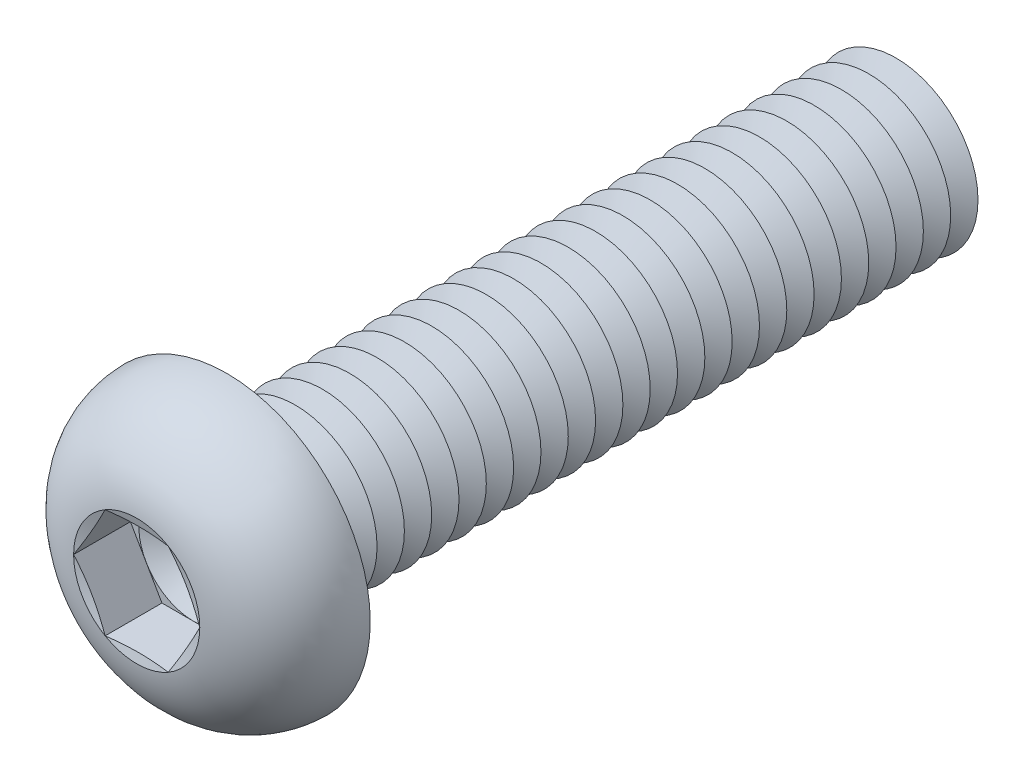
ISO-10303-21;
HEADER;
FILE_DESCRIPTION(('STEP AP214'),'2;1');
FILE_NAME('part.step','',(''),(''),'','','');
FILE_SCHEMA(('AUTOMOTIVE_DESIGN { 1 0 10303 214 1 1 1 1 }'));
ENDSEC;
DATA;
#1=APPLICATION_CONTEXT('core data for automotive mechanical design processes');
#2=APPLICATION_PROTOCOL_DEFINITION('international standard','automotive_design',2000,#1);
#3=PRODUCT_CONTEXT('',#1,'mechanical');
#4=PRODUCT('Part','Part','',(#3));
#5=PRODUCT_RELATED_PRODUCT_CATEGORY('part','',(#4));
#6=PRODUCT_DEFINITION_FORMATION('','',#4);
#7=PRODUCT_DEFINITION_CONTEXT('part definition',#1,'design');
#8=PRODUCT_DEFINITION('design','',#6,#7);
#9=PRODUCT_DEFINITION_SHAPE('','',#8);
#10=(LENGTH_UNIT() NAMED_UNIT(*) SI_UNIT(.MILLI.,.METRE.));
#11=(NAMED_UNIT(*) PLANE_ANGLE_UNIT() SI_UNIT($,.RADIAN.));
#12=(NAMED_UNIT(*) SI_UNIT($,.STERADIAN.) SOLID_ANGLE_UNIT());
#13=UNCERTAINTY_MEASURE_WITH_UNIT(LENGTH_MEASURE(1.E-05),#10,'distance_accuracy_value','');
#14=(GEOMETRIC_REPRESENTATION_CONTEXT(3) GLOBAL_UNCERTAINTY_ASSIGNED_CONTEXT((#13)) GLOBAL_UNIT_ASSIGNED_CONTEXT((#10,
#11,#12)) REPRESENTATION_CONTEXT('',''));
#15=CARTESIAN_POINT('',(0.,0.,0.));
#16=DIRECTION('',(0.,0.,1.));
#17=DIRECTION('',(1.,0.,0.));
#18=AXIS2_PLACEMENT_3D('',#15,#16,#17);
#19=CARTESIAN_POINT('',(0.,0.,1.22));
#20=DIRECTION('',(0.,0.,1.));
#21=DIRECTION('',(1.,0.,0.));
#22=AXIS2_PLACEMENT_3D('',#19,#20,#21);
#23=PLANE('',#22);
#24=CARTESIAN_POINT('',(0.,0.,1.22));
#25=DIRECTION('',(0.,0.,1.));
#26=DIRECTION('',(1.,0.,0.));
#27=AXIS2_PLACEMENT_3D('',#24,#25,#26);
#28=CIRCLE('',#27,1.99999906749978);
#29=CARTESIAN_POINT('',(1.73205,0.999999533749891,1.22));
#30=VERTEX_POINT('',#29);
#31=CARTESIAN_POINT('',(0.,1.99999906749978,1.22));
#32=VERTEX_POINT('',#31);
#33=EDGE_CURVE('E118',#30,#32,#28,.T.);
#34=ORIENTED_EDGE('',*,*,#33,.F.);
#35=DIRECTION('',(-0.5,0.866025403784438,0.));
#36=VECTOR('',#35,1.);
#37=CARTESIAN_POINT('',(2.3094,0.,1.22));
#38=LINE('',#37,#36);
#39=CARTESIAN_POINT('',(1.1547,1.99999906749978,1.22));
#40=VERTEX_POINT('',#39);
#41=EDGE_CURVE('E125',#30,#40,#38,.T.);
#42=ORIENTED_EDGE('',*,*,#41,.T.);
#43=DIRECTION('',(-1.,0.,0.));
#44=VECTOR('',#43,1.);
#45=CARTESIAN_POINT('',(1.1547,1.99999906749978,1.22));
#46=LINE('',#45,#44);
#47=EDGE_CURVE('E136',#40,#32,#46,.T.);
#48=ORIENTED_EDGE('',*,*,#47,.T.);
#49=EDGE_LOOP('',(#34,#42,#48));
#50=FACE_BOUND('',#49,.T.);
#51=ADVANCED_FACE('F39',(#50),#23,.T.);
#52=CARTESIAN_POINT('',(0.,0.,1.22));
#53=DIRECTION('',(0.,0.,1.));
#54=DIRECTION('',(1.,0.,0.));
#55=AXIS2_PLACEMENT_3D('',#52,#53,#54);
#56=CIRCLE('',#55,1.99999906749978);
#57=CARTESIAN_POINT('',(-1.73205,0.999999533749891,1.22));
#58=VERTEX_POINT('',#57);
#59=EDGE_CURVE('E11',#32,#58,#56,.T.);
#60=ORIENTED_EDGE('',*,*,#59,.F.);
#61=CARTESIAN_POINT('',(-1.1547,1.99999906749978,1.22));
#62=VERTEX_POINT('',#61);
#63=EDGE_CURVE('E131',#32,#62,#46,.T.);
#64=ORIENTED_EDGE('',*,*,#63,.T.);
#65=DIRECTION('',(-0.5,-0.866025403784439,0.));
#66=VECTOR('',#65,1.);
#67=CARTESIAN_POINT('',(-1.1547,1.99999906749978,1.22));
#68=LINE('',#67,#66);
#69=EDGE_CURVE('E134',#62,#58,#68,.T.);
#70=ORIENTED_EDGE('',*,*,#69,.T.);
#71=EDGE_LOOP('',(#60,#64,#70));
#72=FACE_BOUND('',#71,.T.);
#73=ADVANCED_FACE('F130',(#72),#23,.T.);
#74=CARTESIAN_POINT('',(-1.73205,-0.999999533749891,1.22));
#75=VERTEX_POINT('',#74);
#76=EDGE_CURVE('E49',#58,#75,#56,.T.);
#77=ORIENTED_EDGE('',*,*,#76,.F.);
#78=CARTESIAN_POINT('',(-2.3094,0.,1.22));
#79=VERTEX_POINT('',#78);
#80=EDGE_CURVE('E143',#58,#79,#68,.T.);
#81=ORIENTED_EDGE('',*,*,#80,.T.);
#82=DIRECTION('',(0.5,-0.866025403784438,0.));
#83=VECTOR('',#82,1.);
#84=CARTESIAN_POINT('',(-2.3094,0.,1.22));
#85=LINE('',#84,#83);
#86=EDGE_CURVE('E152',#79,#75,#85,.T.);
#87=ORIENTED_EDGE('',*,*,#86,.T.);
#88=EDGE_LOOP('',(#77,#81,#87));
#89=FACE_BOUND('',#88,.T.);
#90=ADVANCED_FACE('F465',(#89),#23,.T.);
#91=CARTESIAN_POINT('',(0.,-1.99999906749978,1.22));
#92=VERTEX_POINT('',#91);
#93=EDGE_CURVE('E451',#75,#92,#56,.T.);
#94=ORIENTED_EDGE('',*,*,#93,.F.);
#95=CARTESIAN_POINT('',(-1.1547,-1.99999906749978,1.22));
#96=VERTEX_POINT('',#95);
#97=EDGE_CURVE('E151',#75,#96,#85,.T.);
#98=ORIENTED_EDGE('',*,*,#97,.T.);
#99=DIRECTION('',(1.,0.,0.));
#100=VECTOR('',#99,1.);
#101=CARTESIAN_POINT('',(-1.1547,-1.99999906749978,1.22));
#102=LINE('',#101,#100);
#103=EDGE_CURVE('E157',#96,#92,#102,.T.);
#104=ORIENTED_EDGE('',*,*,#103,.T.);
#105=EDGE_LOOP('',(#94,#98,#104));
#106=FACE_BOUND('',#105,.T.);
#107=ADVANCED_FACE('F458',(#106),#23,.T.);
#108=CARTESIAN_POINT('',(1.73205,-0.999999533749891,1.22));
#109=VERTEX_POINT('',#108);
#110=EDGE_CURVE('E56',#92,#109,#56,.T.);
#111=ORIENTED_EDGE('',*,*,#110,.F.);
#112=CARTESIAN_POINT('',(1.1547,-1.99999906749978,1.22));
#113=VERTEX_POINT('',#112);
#114=EDGE_CURVE('E156',#92,#113,#102,.T.);
#115=ORIENTED_EDGE('',*,*,#114,.T.);
#116=DIRECTION('',(0.5,0.866025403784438,0.));
#117=VECTOR('',#116,1.);
#118=CARTESIAN_POINT('',(1.1547,-1.99999906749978,1.22));
#119=LINE('',#118,#117);
#120=EDGE_CURVE('E162',#113,#109,#119,.T.);
#121=ORIENTED_EDGE('',*,*,#120,.T.);
#122=EDGE_LOOP('',(#111,#115,#121));
#123=FACE_BOUND('',#122,.T.);
#124=ADVANCED_FACE('F549',(#123),#23,.T.);
#125=CARTESIAN_POINT('',(0.,0.,3.3));
#126=DIRECTION('',(0.,0.,1.));
#127=DIRECTION('',(1.,0.,0.));
#128=AXIS2_PLACEMENT_3D('',#125,#126,#127);
#129=CONICAL_SURFACE('',#128,2.3094,1.30899693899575);
#130=CARTESIAN_POINT('',(2.30951547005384,-0.000199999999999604,3.30003094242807));
#131=CARTESIAN_POINT('',(2.26155412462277,0.0828714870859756,3.2871729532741));
#132=CARTESIAN_POINT('',(2.21350580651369,0.16609361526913,3.27549992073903));
#133=CARTESIAN_POINT('',(2.11723944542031,0.332831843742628,3.2549913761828));
#134=CARTESIAN_POINT('',(2.06902134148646,0.416348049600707,3.24615701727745));
#135=CARTESIAN_POINT('',(1.97270782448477,0.583167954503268,3.23184167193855));
#136=CARTESIAN_POINT('',(1.92461306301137,0.666470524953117,3.22634360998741));
#137=CARTESIAN_POINT('',(1.82836219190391,0.83318192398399,3.21897125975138));
#138=CARTESIAN_POINT('',(1.78020609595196,0.91659072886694,3.21709626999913));
#139=CARTESIAN_POINT('',(1.68389390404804,1.08340833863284,3.21709626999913));
#140=CARTESIAN_POINT('',(1.63573780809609,1.16681714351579,3.21897125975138));
#141=CARTESIAN_POINT('',(1.53948693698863,1.33352854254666,3.22634360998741));
#142=CARTESIAN_POINT('',(1.49139217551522,1.41683111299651,3.23184167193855));
#143=CARTESIAN_POINT('',(1.39507865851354,1.58365101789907,3.24615701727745));
#144=CARTESIAN_POINT('',(1.34686055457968,1.66716722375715,3.2549913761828));
#145=CARTESIAN_POINT('',(1.25059419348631,1.83390545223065,3.27549992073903));
#146=CARTESIAN_POINT('',(1.20254587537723,1.91712758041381,3.2871729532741));
#147=CARTESIAN_POINT('',(1.15458452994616,2.00019906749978,3.30003094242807));
#148=B_SPLINE_CURVE_WITH_KNOTS('',3,(#130,#131,#132,#133,#134,#135,#136,#137,#138,#139,#140,
#141,#142,#143,#144,#145,#146,#147),.UNSPECIFIED.,.F.,.F.,(4,2,2,2,2,2,2,2,4),(0.,
0.290357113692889,0.580832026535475,0.869807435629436,1.15872689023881,1.44764634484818,
1.73662175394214,2.02709666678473,2.31745378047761),.UNSPECIFIED.);
#149=CARTESIAN_POINT('',(2.3094,0.,3.3));
#150=VERTEX_POINT('',#149);
#151=CARTESIAN_POINT('',(1.15469999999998,1.99999906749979,3.3));
#152=VERTEX_POINT('',#151);
#153=EDGE_CURVE('E221',#150,#152,#148,.T.);
#154=ORIENTED_EDGE('',*,*,#153,.F.);
#155=CARTESIAN_POINT('',(0.,0.,3.3));
#156=DIRECTION('',(0.,0.,-1.));
#157=DIRECTION('',(-1.,0.,0.));
#158=AXIS2_PLACEMENT_3D('',#155,#156,#157);
#159=CIRCLE('',#158,2.3094);
#160=EDGE_CURVE('E496',#152,#150,#159,.T.);
#161=ORIENTED_EDGE('',*,*,#160,.F.);
#162=EDGE_LOOP('',(#154,#161));
#163=FACE_BOUND('',#162,.T.);
#164=ADVANCED_FACE('F516',(#163),#129,.F.);
#165=CARTESIAN_POINT('',(1.15458452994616,-2.00019906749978,3.30003094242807));
#166=CARTESIAN_POINT('',(1.20254587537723,-1.91712758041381,3.2871729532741));
#167=CARTESIAN_POINT('',(1.25059419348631,-1.83390545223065,3.27549992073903));
#168=CARTESIAN_POINT('',(1.34686055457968,-1.66716722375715,3.2549913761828));
#169=CARTESIAN_POINT('',(1.39507865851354,-1.58365101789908,3.24615701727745));
#170=CARTESIAN_POINT('',(1.49139217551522,-1.41683111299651,3.23184167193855));
#171=CARTESIAN_POINT('',(1.53948693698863,-1.33352854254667,3.22634360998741));
#172=CARTESIAN_POINT('',(1.63573780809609,-1.16681714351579,3.21897125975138));
#173=CARTESIAN_POINT('',(1.68389390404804,-1.08340833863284,3.21709626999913));
#174=CARTESIAN_POINT('',(1.78020609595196,-0.916590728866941,3.21709626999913));
#175=CARTESIAN_POINT('',(1.82836219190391,-0.833181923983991,3.21897125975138));
#176=CARTESIAN_POINT('',(1.92461306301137,-0.666470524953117,3.22634360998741));
#177=CARTESIAN_POINT('',(1.97270782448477,-0.583167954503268,3.23184167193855));
#178=CARTESIAN_POINT('',(2.06902134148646,-0.416348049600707,3.24615701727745));
#179=CARTESIAN_POINT('',(2.11723944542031,-0.332831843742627,3.2549913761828));
#180=CARTESIAN_POINT('',(2.21350580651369,-0.166093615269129,3.27549992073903));
#181=CARTESIAN_POINT('',(2.26155412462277,-0.0828714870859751,3.2871729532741));
#182=CARTESIAN_POINT('',(2.30951547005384,0.000200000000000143,3.30003094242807));
#183=B_SPLINE_CURVE_WITH_KNOTS('',3,(#165,#166,#167,#168,#169,#170,#171,#172,#173,#174,#175,
#176,#177,#178,#179,#180,#181,#182),.UNSPECIFIED.,.F.,.F.,(4,2,2,2,2,2,2,2,4),(0.,
0.290357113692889,0.580832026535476,0.869807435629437,1.15872689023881,1.44764634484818,
1.73662175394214,2.02709666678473,2.31745378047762),.UNSPECIFIED.);
#184=CARTESIAN_POINT('',(1.1547,-1.99999906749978,3.3));
#185=VERTEX_POINT('',#184);
#186=EDGE_CURVE('E230',#185,#150,#183,.T.);
#187=ORIENTED_EDGE('',*,*,#186,.F.);
#188=EDGE_CURVE('E498',#150,#185,#159,.T.);
#189=ORIENTED_EDGE('',*,*,#188,.F.);
#190=EDGE_LOOP('',(#187,#189));
#191=FACE_BOUND('',#190,.T.);
#192=ADVANCED_FACE('F518',(#191),#129,.F.);
#193=CARTESIAN_POINT('',(-3.4849337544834,-1.99999906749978,3.75783251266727));
#194=CARTESIAN_POINT('',(-3.40057136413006,-1.99999906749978,3.73822859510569));
#195=CARTESIAN_POINT('',(-3.31617090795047,-1.99999906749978,3.71878852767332));
#196=CARTESIAN_POINT('',(-3.14727791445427,-1.99999906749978,3.68030638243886));
#197=CARTESIAN_POINT('',(-3.06278537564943,-1.99999906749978,3.66126431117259));
#198=CARTESIAN_POINT('',(-2.80911712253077,-1.99999906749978,3.60483420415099));
#199=CARTESIAN_POINT('',(-2.63978343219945,-1.99999906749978,3.5681499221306));
#200=CARTESIAN_POINT('',(-2.29895421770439,-1.99999906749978,3.49717072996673));
#201=CARTESIAN_POINT('',(-2.12745330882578,-1.99999906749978,3.4629014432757));
#202=CARTESIAN_POINT('',(-1.78364663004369,-1.99999906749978,3.39849485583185));
#203=CARTESIAN_POINT('',(-1.61134079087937,-1.99999906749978,3.36835791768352));
#204=CARTESIAN_POINT('',(-1.27040784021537,-1.99999906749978,3.31501553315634));
#205=CARTESIAN_POINT('',(-1.10180724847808,-1.99999906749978,3.291644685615));
#206=CARTESIAN_POINT('',(-0.763641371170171,-1.99999906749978,3.2533727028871));
#207=CARTESIAN_POINT('',(-0.594076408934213,-1.99999906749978,3.23846888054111));
#208=CARTESIAN_POINT('',(-0.339649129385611,-1.99999906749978,3.22431372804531));
#209=CARTESIAN_POINT('',(-0.255009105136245,-1.99999906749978,3.22096057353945));
#210=CARTESIAN_POINT('',(-0.0856618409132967,-1.99999906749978,3.21711210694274));
#211=CARTESIAN_POINT('',(-0.000954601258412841,-1.99999906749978,3.2166167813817));
#212=CARTESIAN_POINT('',(0.168430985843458,-1.99999906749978,3.21851478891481));
#213=CARTESIAN_POINT('',(0.25310933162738,-1.99999906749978,3.2209082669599));
#214=CARTESIAN_POINT('',(0.422344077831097,-1.99999906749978,3.22845792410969));
#215=CARTESIAN_POINT('',(0.506900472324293,-1.99999906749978,3.23361423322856));
#216=CARTESIAN_POINT('',(0.712240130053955,-1.99999906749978,3.24921577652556));
#217=CARTESIAN_POINT('',(0.832922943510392,-1.99999906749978,3.26098285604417));
#218=CARTESIAN_POINT('',(1.07378161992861,-1.99999906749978,3.28874908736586));
#219=CARTESIAN_POINT('',(1.1939575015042,-1.99999906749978,3.30474808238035));
#220=CARTESIAN_POINT('',(1.43419655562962,-1.99999906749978,3.34009172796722));
#221=CARTESIAN_POINT('',(1.55425817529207,-1.99999906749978,3.35944677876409));
#222=CARTESIAN_POINT('',(1.79394991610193,-1.99999906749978,3.40067076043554));
#223=CARTESIAN_POINT('',(1.91358001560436,-1.99999906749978,3.42253981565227));
#224=CARTESIAN_POINT('',(2.15493405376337,-1.99999906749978,3.46864194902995));
#225=CARTESIAN_POINT('',(2.27665041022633,-1.99999906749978,3.49291441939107));
#226=CARTESIAN_POINT('',(2.51977680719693,-1.99999906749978,3.54294628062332));
#227=CARTESIAN_POINT('',(2.64118684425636,-1.99999906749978,3.56870568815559));
#228=CARTESIAN_POINT('',(2.88310060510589,-1.99999906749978,3.62120891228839));
#229=CARTESIAN_POINT('',(3.00360566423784,-1.99999906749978,3.6479466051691));
#230=CARTESIAN_POINT('',(3.24441021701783,-1.99999906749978,3.7022947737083));
#231=CARTESIAN_POINT('',(3.36470972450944,-1.99999906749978,3.72990518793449));
#232=CARTESIAN_POINT('',(3.4849337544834,-1.99999906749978,3.75783251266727));
#233=B_SPLINE_CURVE_WITH_KNOTS('',3,(#193,#194,#195,#196,#197,#198,#199,#200,#201,#202,#203,
#204,#205,#206,#207,#208,#209,#210,#211,#212,#213,#214,#215,#216,#217,#218,#219,#220,#221,#222,
#223,#224,#225,#226,#227,#228,#229,#230,#231,#232),.UNSPECIFIED.,.F.,.F.,(4,2,2,2,2,2,2,2,2,2,2,
2,2,2,2,2,2,2,2,4),(0.,0.259830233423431,0.519664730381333,1.03943435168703,1.56407662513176,
2.08876490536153,2.59926476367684,3.10960251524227,3.36367930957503,3.61775490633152,
3.87184325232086,4.1259435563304,4.48960924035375,4.85326145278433,5.21806142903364,
5.58287945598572,5.95520617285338,6.32753706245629,6.69784064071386,7.06811821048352),.UNSPECIFIED.);
#234=CARTESIAN_POINT('',(-1.1547,-1.99999906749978,3.3));
#235=VERTEX_POINT('',#234);
#236=EDGE_CURVE('E477',#235,#185,#233,.T.);
#237=ORIENTED_EDGE('',*,*,#236,.F.);
#238=EDGE_CURVE('E485',#185,#235,#159,.T.);
#239=ORIENTED_EDGE('',*,*,#238,.F.);
#240=EDGE_LOOP('',(#237,#239));
#241=FACE_BOUND('',#240,.T.);
#242=ADVANCED_FACE('F521',(#241),#129,.F.);
#243=CARTESIAN_POINT('',(-2.30951547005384,0.000200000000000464,3.30003094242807));
#244=CARTESIAN_POINT('',(-2.26155412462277,-0.0828714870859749,3.2871729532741));
#245=CARTESIAN_POINT('',(-2.21350580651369,-0.166093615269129,3.27549992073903));
#246=CARTESIAN_POINT('',(-2.11723944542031,-0.332831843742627,3.2549913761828));
#247=CARTESIAN_POINT('',(-2.06902134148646,-0.416348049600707,3.24615701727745));
#248=CARTESIAN_POINT('',(-1.97270782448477,-0.583167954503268,3.23184167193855));
#249=CARTESIAN_POINT('',(-1.92461306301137,-0.666470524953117,3.22634360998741));
#250=CARTESIAN_POINT('',(-1.82836219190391,-0.833181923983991,3.21897125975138));
#251=CARTESIAN_POINT('',(-1.78020609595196,-0.916590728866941,3.21709626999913));
#252=CARTESIAN_POINT('',(-1.68389390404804,-1.08340833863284,3.21709626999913));
#253=CARTESIAN_POINT('',(-1.63573780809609,-1.16681714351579,3.21897125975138));
#254=CARTESIAN_POINT('',(-1.53948693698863,-1.33352854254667,3.22634360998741));
#255=CARTESIAN_POINT('',(-1.49139217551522,-1.41683111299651,3.23184167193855));
#256=CARTESIAN_POINT('',(-1.39507865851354,-1.58365101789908,3.24615701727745));
#257=CARTESIAN_POINT('',(-1.34686055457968,-1.66716722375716,3.2549913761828));
#258=CARTESIAN_POINT('',(-1.25059419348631,-1.83390545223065,3.27549992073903));
#259=CARTESIAN_POINT('',(-1.20254587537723,-1.91712758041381,3.2871729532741));
#260=CARTESIAN_POINT('',(-1.15458452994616,-2.00019906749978,3.30003094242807));
#261=B_SPLINE_CURVE_WITH_KNOTS('',3,(#243,#244,#245,#246,#247,#248,#249,#250,#251,#252,#253,
#254,#255,#256,#257,#258,#259,#260),.UNSPECIFIED.,.F.,.F.,(4,2,2,2,2,2,2,2,4),(0.,
0.290357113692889,0.580832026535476,0.869807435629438,1.15872689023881,1.44764634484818,
1.73662175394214,2.02709666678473,2.31745378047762),.UNSPECIFIED.);
#262=CARTESIAN_POINT('',(-2.3094,0.,3.3));
#263=VERTEX_POINT('',#262);
#264=EDGE_CURVE('E470',#263,#235,#261,.T.);
#265=ORIENTED_EDGE('',*,*,#264,.F.);
#266=EDGE_CURVE('E435',#235,#263,#159,.T.);
#267=ORIENTED_EDGE('',*,*,#266,.F.);
#268=EDGE_LOOP('',(#265,#267));
#269=FACE_BOUND('',#268,.T.);
#270=ADVANCED_FACE('F474',(#269),#129,.F.);
#271=CARTESIAN_POINT('',(-1.15458452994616,2.00019906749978,3.30003094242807));
#272=CARTESIAN_POINT('',(-1.20254587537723,1.91712758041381,3.2871729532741));
#273=CARTESIAN_POINT('',(-1.25059419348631,1.83390545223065,3.27549992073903));
#274=CARTESIAN_POINT('',(-1.34686055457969,1.66716722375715,3.2549913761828));
#275=CARTESIAN_POINT('',(-1.39507865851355,1.58365101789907,3.24615701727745));
#276=CARTESIAN_POINT('',(-1.49139217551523,1.41683111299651,3.23184167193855));
#277=CARTESIAN_POINT('',(-1.53948693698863,1.33352854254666,3.22634360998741));
#278=CARTESIAN_POINT('',(-1.63573780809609,1.16681714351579,3.21897125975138));
#279=CARTESIAN_POINT('',(-1.68389390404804,1.08340833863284,3.21709626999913));
#280=CARTESIAN_POINT('',(-1.78020609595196,0.91659072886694,3.21709626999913));
#281=CARTESIAN_POINT('',(-1.82836219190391,0.83318192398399,3.21897125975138));
#282=CARTESIAN_POINT('',(-1.92461306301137,0.666470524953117,3.22634360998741));
#283=CARTESIAN_POINT('',(-1.97270782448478,0.583167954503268,3.23184167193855));
#284=CARTESIAN_POINT('',(-2.06902134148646,0.416348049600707,3.24615701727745));
#285=CARTESIAN_POINT('',(-2.11723944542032,0.332831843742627,3.2549913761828));
#286=CARTESIAN_POINT('',(-2.21350580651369,0.166093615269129,3.27549992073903));
#287=CARTESIAN_POINT('',(-2.26155412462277,0.0828714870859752,3.2871729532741));
#288=CARTESIAN_POINT('',(-2.30951547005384,-0.000200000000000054,3.30003094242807));
#289=B_SPLINE_CURVE_WITH_KNOTS('',3,(#271,#272,#273,#274,#275,#276,#277,#278,#279,#280,#281,
#282,#283,#284,#285,#286,#287,#288),.UNSPECIFIED.,.F.,.F.,(4,2,2,2,2,2,2,2,4),(0.,
0.290357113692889,0.580832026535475,0.869807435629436,1.15872689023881,1.44764634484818,
1.73662175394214,2.02709666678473,2.31745378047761),.UNSPECIFIED.);
#290=CARTESIAN_POINT('',(-1.1547,1.99999906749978,3.3));
#291=VERTEX_POINT('',#290);
#292=EDGE_CURVE('E195',#291,#263,#289,.T.);
#293=ORIENTED_EDGE('',*,*,#292,.F.);
#294=EDGE_CURVE('E436',#263,#291,#159,.T.);
#295=ORIENTED_EDGE('',*,*,#294,.F.);
#296=EDGE_LOOP('',(#293,#295));
#297=FACE_BOUND('',#296,.T.);
#298=ADVANCED_FACE('F488',(#297),#129,.F.);
#299=CARTESIAN_POINT('',(0.,0.,-21.5));
#300=DIRECTION('',(0.,0.,1.));
#301=DIRECTION('',(1.,0.,0.));
#302=AXIS2_PLACEMENT_3D('',#299,#300,#301);
#303=CONICAL_SURFACE('',#302,3.00000000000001,1.0471975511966);
#304=CARTESIAN_POINT('',(0.,0.,-22.));
#305=DIRECTION('',(0.,0.,1.));
#306=DIRECTION('',(1.,0.,0.));
#307=AXIS2_PLACEMENT_3D('',#304,#305,#306);
#308=CIRCLE('',#307,2.13397459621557);
#309=CARTESIAN_POINT('',(2.13397459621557,0.,-22.));
#310=VERTEX_POINT('',#309);
#311=EDGE_CURVE('E408',#310,#310,#308,.T.);
#312=ORIENTED_EDGE('',*,*,#311,.T.);
#313=EDGE_LOOP('',(#312));
#314=FACE_BOUND('',#313,.T.);
#315=CARTESIAN_POINT('',(0.,0.,-21.5));
#316=DIRECTION('',(0.,0.,1.));
#317=DIRECTION('',(1.,0.,0.));
#318=AXIS2_PLACEMENT_3D('',#315,#316,#317);
#319=CIRCLE('',#318,3.00000000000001);
#320=CARTESIAN_POINT('',(3.00000000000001,0.,-21.5));
#321=VERTEX_POINT('',#320);
#322=EDGE_CURVE('E404',#321,#321,#319,.T.);
#323=ORIENTED_EDGE('',*,*,#322,.F.);
#324=EDGE_LOOP('',(#323));
#325=FACE_BOUND('',#324,.T.);
#326=ADVANCED_FACE('F602',(#314,#325),#303,.T.);
#327=CARTESIAN_POINT('',(0.,0.,-22.));
#328=DIRECTION('',(0.,0.,-1.));
#329=DIRECTION('',(-1.,0.,0.));
#330=AXIS2_PLACEMENT_3D('',#327,#328,#329);
#331=CONICAL_SURFACE('',#330,2.13397459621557,1.0471975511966);
#332=CARTESIAN_POINT('',(0.,0.,-22.5));
#333=DIRECTION('',(0.,0.,1.));
#334=DIRECTION('',(1.,0.,0.));
#335=AXIS2_PLACEMENT_3D('',#332,#333,#334);
#336=CIRCLE('',#335,3.00000000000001);
#337=CARTESIAN_POINT('',(3.00000000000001,0.,-22.5));
#338=VERTEX_POINT('',#337);
#339=EDGE_CURVE('E412',#338,#338,#336,.T.);
#340=ORIENTED_EDGE('',*,*,#339,.T.);
#341=EDGE_LOOP('',(#340));
#342=FACE_BOUND('',#341,.T.);
#343=ORIENTED_EDGE('',*,*,#311,.F.);
#344=EDGE_LOOP('',(#343));
#345=FACE_BOUND('',#344,.T.);
#346=ADVANCED_FACE('F1093',(#342,#345),#331,.T.);
#347=CARTESIAN_POINT('',(0.,3.00000000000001,-25.));
#348=DIRECTION('',(0.,0.,-1.));
#349=DIRECTION('',(-1.,0.,0.));
#350=AXIS2_PLACEMENT_3D('',#347,#348,#349);
#351=PLANE('',#350);
#352=CARTESIAN_POINT('',(0.,0.,-25.));
#353=DIRECTION('',(0.,0.,1.));
#354=DIRECTION('',(1.,0.,0.));
#355=AXIS2_PLACEMENT_3D('',#352,#353,#354);
#356=CIRCLE('',#355,2.13397459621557);
#357=CARTESIAN_POINT('',(2.13397459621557,0.,-25.));
#358=VERTEX_POINT('',#357);
#359=EDGE_CURVE('E431',#358,#358,#356,.T.);
#360=ORIENTED_EDGE('',*,*,#359,.F.);
#361=EDGE_LOOP('',(#360));
#362=FACE_BOUND('',#361,.T.);
#363=ADVANCED_FACE('F1098',(#362),#351,.T.);
#364=CARTESIAN_POINT('',(0.,0.,-24.5));
#365=DIRECTION('',(0.,0.,1.));
#366=DIRECTION('',(1.,0.,0.));
#367=AXIS2_PLACEMENT_3D('',#364,#365,#366);
#368=CONICAL_SURFACE('',#367,3.00000000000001,1.0471975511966);
#369=ORIENTED_EDGE('',*,*,#359,.T.);
#370=EDGE_LOOP('',(#369));
#371=FACE_BOUND('',#370,.T.);
#372=CARTESIAN_POINT('',(0.,0.,-24.5));
#373=DIRECTION('',(0.,0.,1.));
#374=DIRECTION('',(1.,0.,0.));
#375=AXIS2_PLACEMENT_3D('',#372,#373,#374);
#376=CIRCLE('',#375,3.00000000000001);
#377=CARTESIAN_POINT('',(3.00000000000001,0.,-24.5));
#378=VERTEX_POINT('',#377);
#379=EDGE_CURVE('E427',#378,#378,#376,.T.);
#380=ORIENTED_EDGE('',*,*,#379,.F.);
#381=EDGE_LOOP('',(#380));
#382=FACE_BOUND('',#381,.T.);
#383=ADVANCED_FACE('F1086',(#371,#382),#368,.T.);
#384=CARTESIAN_POINT('',(0.,0.,-24.));
#385=DIRECTION('',(0.,0.,-1.));
#386=DIRECTION('',(-1.,0.,0.));
#387=AXIS2_PLACEMENT_3D('',#384,#385,#386);
#388=CONICAL_SURFACE('',#387,2.13397459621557,1.0471975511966);
#389=ORIENTED_EDGE('',*,*,#379,.T.);
#390=EDGE_LOOP('',(#389));
#391=FACE_BOUND('',#390,.T.);
#392=CARTESIAN_POINT('',(0.,0.,-24.));
#393=DIRECTION('',(0.,0.,1.));
#394=DIRECTION('',(1.,0.,0.));
#395=AXIS2_PLACEMENT_3D('',#392,#393,#394);
#396=CIRCLE('',#395,2.13397459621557);
#397=CARTESIAN_POINT('',(2.13397459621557,0.,-24.));
#398=VERTEX_POINT('',#397);
#399=EDGE_CURVE('E423',#398,#398,#396,.T.);
#400=ORIENTED_EDGE('',*,*,#399,.F.);
#401=EDGE_LOOP('',(#400));
#402=FACE_BOUND('',#401,.T.);
#403=ADVANCED_FACE('F1076',(#391,#402),#388,.T.);
#404=CARTESIAN_POINT('',(0.,0.,-23.5));
#405=DIRECTION('',(0.,0.,1.));
#406=DIRECTION('',(1.,0.,0.));
#407=AXIS2_PLACEMENT_3D('',#404,#405,#406);
#408=CONICAL_SURFACE('',#407,3.00000000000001,1.0471975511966);
#409=ORIENTED_EDGE('',*,*,#399,.T.);
#410=EDGE_LOOP('',(#409));
#411=FACE_BOUND('',#410,.T.);
#412=CARTESIAN_POINT('',(0.,0.,-23.5));
#413=DIRECTION('',(0.,0.,1.));
#414=DIRECTION('',(1.,0.,0.));
#415=AXIS2_PLACEMENT_3D('',#412,#413,#414);
#416=CIRCLE('',#415,3.00000000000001);
#417=CARTESIAN_POINT('',(3.00000000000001,0.,-23.5));
#418=VERTEX_POINT('',#417);
#419=EDGE_CURVE('E419',#418,#418,#416,.T.);
#420=ORIENTED_EDGE('',*,*,#419,.F.);
#421=EDGE_LOOP('',(#420));
#422=FACE_BOUND('',#421,.T.);
#423=ADVANCED_FACE('F1066',(#411,#422),#408,.T.);
#424=CARTESIAN_POINT('',(0.,0.,-23.));
#425=DIRECTION('',(0.,0.,-1.));
#426=DIRECTION('',(-1.,0.,0.));
#427=AXIS2_PLACEMENT_3D('',#424,#425,#426);
#428=CONICAL_SURFACE('',#427,2.13397459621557,1.0471975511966);
#429=ORIENTED_EDGE('',*,*,#419,.T.);
#430=EDGE_LOOP('',(#429));
#431=FACE_BOUND('',#430,.T.);
#432=CARTESIAN_POINT('',(0.,0.,-23.));
#433=DIRECTION('',(0.,0.,1.));
#434=DIRECTION('',(1.,0.,0.));
#435=AXIS2_PLACEMENT_3D('',#432,#433,#434);
#436=CIRCLE('',#435,2.13397459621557);
#437=CARTESIAN_POINT('',(2.13397459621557,0.,-23.));
#438=VERTEX_POINT('',#437);
#439=EDGE_CURVE('E415',#438,#438,#436,.T.);
#440=ORIENTED_EDGE('',*,*,#439,.F.);
#441=EDGE_LOOP('',(#440));
#442=FACE_BOUND('',#441,.T.);
#443=ADVANCED_FACE('F1056',(#431,#442),#428,.T.);
#444=CARTESIAN_POINT('',(0.,0.,-22.5));
#445=DIRECTION('',(0.,0.,1.));
#446=DIRECTION('',(1.,0.,0.));
#447=AXIS2_PLACEMENT_3D('',#444,#445,#446);
#448=CONICAL_SURFACE('',#447,3.00000000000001,1.0471975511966);
#449=ORIENTED_EDGE('',*,*,#439,.T.);
#450=EDGE_LOOP('',(#449));
#451=FACE_BOUND('',#450,.T.);
#452=ORIENTED_EDGE('',*,*,#339,.F.);
#453=EDGE_LOOP('',(#452));
#454=FACE_BOUND('',#453,.T.);
#455=ADVANCED_FACE('F1046',(#451,#454),#448,.T.);
#456=CARTESIAN_POINT('',(0.,0.,-20.5));
#457=DIRECTION('',(0.,0.,1.));
#458=DIRECTION('',(1.,0.,0.));
#459=AXIS2_PLACEMENT_3D('',#456,#457,#458);
#460=CONICAL_SURFACE('',#459,3.00000000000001,1.0471975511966);
#461=CARTESIAN_POINT('',(0.,0.,-21.));
#462=DIRECTION('',(0.,0.,1.));
#463=DIRECTION('',(1.,0.,0.));
#464=AXIS2_PLACEMENT_3D('',#461,#462,#463);
#465=CIRCLE('',#464,2.13397459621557);
#466=CARTESIAN_POINT('',(2.13397459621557,0.,-21.));
#467=VERTEX_POINT('',#466);
#468=EDGE_CURVE('E400',#467,#467,#465,.T.);
#469=ORIENTED_EDGE('',*,*,#468,.T.);
#470=EDGE_LOOP('',(#469));
#471=FACE_BOUND('',#470,.T.);
#472=CARTESIAN_POINT('',(0.,0.,-20.5));
#473=DIRECTION('',(0.,0.,1.));
#474=DIRECTION('',(1.,0.,0.));
#475=AXIS2_PLACEMENT_3D('',#472,#473,#474);
#476=CIRCLE('',#475,3.00000000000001);
#477=CARTESIAN_POINT('',(3.00000000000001,0.,-20.5));
#478=VERTEX_POINT('',#477);
#479=EDGE_CURVE('E396',#478,#478,#476,.T.);
#480=ORIENTED_EDGE('',*,*,#479,.F.);
#481=EDGE_LOOP('',(#480));
#482=FACE_BOUND('',#481,.T.);
#483=ADVANCED_FACE('F1036',(#471,#482),#460,.T.);
#484=CARTESIAN_POINT('',(0.,0.,-21.));
#485=DIRECTION('',(0.,0.,-1.));
#486=DIRECTION('',(-1.,0.,0.));
#487=AXIS2_PLACEMENT_3D('',#484,#485,#486);
#488=CONICAL_SURFACE('',#487,2.13397459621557,1.0471975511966);
#489=ORIENTED_EDGE('',*,*,#322,.T.);
#490=EDGE_LOOP('',(#489));
#491=FACE_BOUND('',#490,.T.);
#492=ORIENTED_EDGE('',*,*,#468,.F.);
#493=EDGE_LOOP('',(#492));
#494=FACE_BOUND('',#493,.T.);
#495=ADVANCED_FACE('F1026',(#491,#494),#488,.T.);
#496=CARTESIAN_POINT('',(0.,0.,-19.5));
#497=DIRECTION('',(0.,0.,1.));
#498=DIRECTION('',(1.,0.,0.));
#499=AXIS2_PLACEMENT_3D('',#496,#497,#498);
#500=CONICAL_SURFACE('',#499,3.00000000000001,1.0471975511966);
#501=CARTESIAN_POINT('',(0.,0.,-20.));
#502=DIRECTION('',(0.,0.,1.));
#503=DIRECTION('',(1.,0.,0.));
#504=AXIS2_PLACEMENT_3D('',#501,#502,#503);
#505=CIRCLE('',#504,2.13397459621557);
#506=CARTESIAN_POINT('',(2.13397459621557,0.,-20.));
#507=VERTEX_POINT('',#506);
#508=EDGE_CURVE('E392',#507,#507,#505,.T.);
#509=ORIENTED_EDGE('',*,*,#508,.T.);
#510=EDGE_LOOP('',(#509));
#511=FACE_BOUND('',#510,.T.);
#512=CARTESIAN_POINT('',(0.,0.,-19.5));
#513=DIRECTION('',(0.,0.,1.));
#514=DIRECTION('',(1.,0.,0.));
#515=AXIS2_PLACEMENT_3D('',#512,#513,#514);
#516=CIRCLE('',#515,3.00000000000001);
#517=CARTESIAN_POINT('',(3.00000000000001,0.,-19.5));
#518=VERTEX_POINT('',#517);
#519=EDGE_CURVE('E388',#518,#518,#516,.T.);
#520=ORIENTED_EDGE('',*,*,#519,.F.);
#521=EDGE_LOOP('',(#520));
#522=FACE_BOUND('',#521,.T.);
#523=ADVANCED_FACE('F1016',(#511,#522),#500,.T.);
#524=CARTESIAN_POINT('',(0.,0.,-20.));
#525=DIRECTION('',(0.,0.,-1.));
#526=DIRECTION('',(-1.,0.,0.));
#527=AXIS2_PLACEMENT_3D('',#524,#525,#526);
#528=CONICAL_SURFACE('',#527,2.13397459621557,1.0471975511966);
#529=ORIENTED_EDGE('',*,*,#479,.T.);
#530=EDGE_LOOP('',(#529));
#531=FACE_BOUND('',#530,.T.);
#532=ORIENTED_EDGE('',*,*,#508,.F.);
#533=EDGE_LOOP('',(#532));
#534=FACE_BOUND('',#533,.T.);
#535=ADVANCED_FACE('F1006',(#531,#534),#528,.T.);
#536=CARTESIAN_POINT('',(0.,0.,-18.5));
#537=DIRECTION('',(0.,0.,1.));
#538=DIRECTION('',(1.,0.,0.));
#539=AXIS2_PLACEMENT_3D('',#536,#537,#538);
#540=CONICAL_SURFACE('',#539,3.00000000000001,1.0471975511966);
#541=CARTESIAN_POINT('',(0.,0.,-19.));
#542=DIRECTION('',(0.,0.,1.));
#543=DIRECTION('',(1.,0.,0.));
#544=AXIS2_PLACEMENT_3D('',#541,#542,#543);
#545=CIRCLE('',#544,2.13397459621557);
#546=CARTESIAN_POINT('',(2.13397459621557,0.,-19.));
#547=VERTEX_POINT('',#546);
#548=EDGE_CURVE('E384',#547,#547,#545,.T.);
#549=ORIENTED_EDGE('',*,*,#548,.T.);
#550=EDGE_LOOP('',(#549));
#551=FACE_BOUND('',#550,.T.);
#552=CARTESIAN_POINT('',(0.,0.,-18.5));
#553=DIRECTION('',(0.,0.,1.));
#554=DIRECTION('',(1.,0.,0.));
#555=AXIS2_PLACEMENT_3D('',#552,#553,#554);
#556=CIRCLE('',#555,3.00000000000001);
#557=CARTESIAN_POINT('',(3.00000000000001,0.,-18.5));
#558=VERTEX_POINT('',#557);
#559=EDGE_CURVE('E380',#558,#558,#556,.T.);
#560=ORIENTED_EDGE('',*,*,#559,.F.);
#561=EDGE_LOOP('',(#560));
#562=FACE_BOUND('',#561,.T.);
#563=ADVANCED_FACE('F996',(#551,#562),#540,.T.);
#564=CARTESIAN_POINT('',(0.,0.,-19.));
#565=DIRECTION('',(0.,0.,-1.));
#566=DIRECTION('',(-1.,0.,0.));
#567=AXIS2_PLACEMENT_3D('',#564,#565,#566);
#568=CONICAL_SURFACE('',#567,2.13397459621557,1.0471975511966);
#569=ORIENTED_EDGE('',*,*,#519,.T.);
#570=EDGE_LOOP('',(#569));
#571=FACE_BOUND('',#570,.T.);
#572=ORIENTED_EDGE('',*,*,#548,.F.);
#573=EDGE_LOOP('',(#572));
#574=FACE_BOUND('',#573,.T.);
#575=ADVANCED_FACE('F986',(#571,#574),#568,.T.);
#576=CARTESIAN_POINT('',(0.,0.,-17.5));
#577=DIRECTION('',(0.,0.,1.));
#578=DIRECTION('',(1.,0.,0.));
#579=AXIS2_PLACEMENT_3D('',#576,#577,#578);
#580=CONICAL_SURFACE('',#579,3.00000000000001,1.0471975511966);
#581=CARTESIAN_POINT('',(0.,0.,-18.));
#582=DIRECTION('',(0.,0.,1.));
#583=DIRECTION('',(1.,0.,0.));
#584=AXIS2_PLACEMENT_3D('',#581,#582,#583);
#585=CIRCLE('',#584,2.13397459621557);
#586=CARTESIAN_POINT('',(2.13397459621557,0.,-18.));
#587=VERTEX_POINT('',#586);
#588=EDGE_CURVE('E376',#587,#587,#585,.T.);
#589=ORIENTED_EDGE('',*,*,#588,.T.);
#590=EDGE_LOOP('',(#589));
#591=FACE_BOUND('',#590,.T.);
#592=CARTESIAN_POINT('',(0.,0.,-17.5));
#593=DIRECTION('',(0.,0.,1.));
#594=DIRECTION('',(1.,0.,0.));
#595=AXIS2_PLACEMENT_3D('',#592,#593,#594);
#596=CIRCLE('',#595,3.00000000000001);
#597=CARTESIAN_POINT('',(3.00000000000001,0.,-17.5));
#598=VERTEX_POINT('',#597);
#599=EDGE_CURVE('E372',#598,#598,#596,.T.);
#600=ORIENTED_EDGE('',*,*,#599,.F.);
#601=EDGE_LOOP('',(#600));
#602=FACE_BOUND('',#601,.T.);
#603=ADVANCED_FACE('F976',(#591,#602),#580,.T.);
#604=CARTESIAN_POINT('',(0.,0.,-18.));
#605=DIRECTION('',(0.,0.,-1.));
#606=DIRECTION('',(-1.,0.,0.));
#607=AXIS2_PLACEMENT_3D('',#604,#605,#606);
#608=CONICAL_SURFACE('',#607,2.13397459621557,1.0471975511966);
#609=ORIENTED_EDGE('',*,*,#559,.T.);
#610=EDGE_LOOP('',(#609));
#611=FACE_BOUND('',#610,.T.);
#612=ORIENTED_EDGE('',*,*,#588,.F.);
#613=EDGE_LOOP('',(#612));
#614=FACE_BOUND('',#613,.T.);
#615=ADVANCED_FACE('F966',(#611,#614),#608,.T.);
#616=CARTESIAN_POINT('',(0.,0.,-16.5));
#617=DIRECTION('',(0.,0.,1.));
#618=DIRECTION('',(1.,0.,0.));
#619=AXIS2_PLACEMENT_3D('',#616,#617,#618);
#620=CONICAL_SURFACE('',#619,3.00000000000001,1.0471975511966);
#621=CARTESIAN_POINT('',(0.,0.,-17.));
#622=DIRECTION('',(0.,0.,1.));
#623=DIRECTION('',(1.,0.,0.));
#624=AXIS2_PLACEMENT_3D('',#621,#622,#623);
#625=CIRCLE('',#624,2.13397459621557);
#626=CARTESIAN_POINT('',(2.13397459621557,0.,-17.));
#627=VERTEX_POINT('',#626);
#628=EDGE_CURVE('E368',#627,#627,#625,.T.);
#629=ORIENTED_EDGE('',*,*,#628,.T.);
#630=EDGE_LOOP('',(#629));
#631=FACE_BOUND('',#630,.T.);
#632=CARTESIAN_POINT('',(0.,0.,-16.5));
#633=DIRECTION('',(0.,0.,1.));
#634=DIRECTION('',(1.,0.,0.));
#635=AXIS2_PLACEMENT_3D('',#632,#633,#634);
#636=CIRCLE('',#635,3.00000000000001);
#637=CARTESIAN_POINT('',(3.00000000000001,0.,-16.5));
#638=VERTEX_POINT('',#637);
#639=EDGE_CURVE('E364',#638,#638,#636,.T.);
#640=ORIENTED_EDGE('',*,*,#639,.F.);
#641=EDGE_LOOP('',(#640));
#642=FACE_BOUND('',#641,.T.);
#643=ADVANCED_FACE('F956',(#631,#642),#620,.T.);
#644=CARTESIAN_POINT('',(0.,0.,-17.));
#645=DIRECTION('',(0.,0.,-1.));
#646=DIRECTION('',(-1.,0.,0.));
#647=AXIS2_PLACEMENT_3D('',#644,#645,#646);
#648=CONICAL_SURFACE('',#647,2.13397459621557,1.0471975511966);
#649=ORIENTED_EDGE('',*,*,#599,.T.);
#650=EDGE_LOOP('',(#649));
#651=FACE_BOUND('',#650,.T.);
#652=ORIENTED_EDGE('',*,*,#628,.F.);
#653=EDGE_LOOP('',(#652));
#654=FACE_BOUND('',#653,.T.);
#655=ADVANCED_FACE('F946',(#651,#654),#648,.T.);
#656=CARTESIAN_POINT('',(0.,0.,-15.5));
#657=DIRECTION('',(0.,0.,1.));
#658=DIRECTION('',(1.,0.,0.));
#659=AXIS2_PLACEMENT_3D('',#656,#657,#658);
#660=CONICAL_SURFACE('',#659,3.00000000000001,1.0471975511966);
#661=CARTESIAN_POINT('',(0.,0.,-16.));
#662=DIRECTION('',(0.,0.,1.));
#663=DIRECTION('',(1.,0.,0.));
#664=AXIS2_PLACEMENT_3D('',#661,#662,#663);
#665=CIRCLE('',#664,2.13397459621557);
#666=CARTESIAN_POINT('',(2.13397459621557,0.,-16.));
#667=VERTEX_POINT('',#666);
#668=EDGE_CURVE('E360',#667,#667,#665,.T.);
#669=ORIENTED_EDGE('',*,*,#668,.T.);
#670=EDGE_LOOP('',(#669));
#671=FACE_BOUND('',#670,.T.);
#672=CARTESIAN_POINT('',(0.,0.,-15.5));
#673=DIRECTION('',(0.,0.,1.));
#674=DIRECTION('',(1.,0.,0.));
#675=AXIS2_PLACEMENT_3D('',#672,#673,#674);
#676=CIRCLE('',#675,3.00000000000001);
#677=CARTESIAN_POINT('',(3.00000000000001,0.,-15.5));
#678=VERTEX_POINT('',#677);
#679=EDGE_CURVE('E356',#678,#678,#676,.T.);
#680=ORIENTED_EDGE('',*,*,#679,.F.);
#681=EDGE_LOOP('',(#680));
#682=FACE_BOUND('',#681,.T.);
#683=ADVANCED_FACE('F936',(#671,#682),#660,.T.);
#684=CARTESIAN_POINT('',(0.,0.,-16.));
#685=DIRECTION('',(0.,0.,-1.));
#686=DIRECTION('',(-1.,0.,0.));
#687=AXIS2_PLACEMENT_3D('',#684,#685,#686);
#688=CONICAL_SURFACE('',#687,2.13397459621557,1.0471975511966);
#689=ORIENTED_EDGE('',*,*,#639,.T.);
#690=EDGE_LOOP('',(#689));
#691=FACE_BOUND('',#690,.T.);
#692=ORIENTED_EDGE('',*,*,#668,.F.);
#693=EDGE_LOOP('',(#692));
#694=FACE_BOUND('',#693,.T.);
#695=ADVANCED_FACE('F926',(#691,#694),#688,.T.);
#696=CARTESIAN_POINT('',(0.,0.,-14.5));
#697=DIRECTION('',(0.,0.,1.));
#698=DIRECTION('',(1.,0.,0.));
#699=AXIS2_PLACEMENT_3D('',#696,#697,#698);
#700=CONICAL_SURFACE('',#699,3.00000000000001,1.0471975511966);
#701=CARTESIAN_POINT('',(0.,0.,-15.));
#702=DIRECTION('',(0.,0.,1.));
#703=DIRECTION('',(1.,0.,0.));
#704=AXIS2_PLACEMENT_3D('',#701,#702,#703);
#705=CIRCLE('',#704,2.13397459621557);
#706=CARTESIAN_POINT('',(2.13397459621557,0.,-15.));
#707=VERTEX_POINT('',#706);
#708=EDGE_CURVE('E352',#707,#707,#705,.T.);
#709=ORIENTED_EDGE('',*,*,#708,.T.);
#710=EDGE_LOOP('',(#709));
#711=FACE_BOUND('',#710,.T.);
#712=CARTESIAN_POINT('',(0.,0.,-14.5));
#713=DIRECTION('',(0.,0.,1.));
#714=DIRECTION('',(1.,0.,0.));
#715=AXIS2_PLACEMENT_3D('',#712,#713,#714);
#716=CIRCLE('',#715,3.00000000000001);
#717=CARTESIAN_POINT('',(3.00000000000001,0.,-14.5));
#718=VERTEX_POINT('',#717);
#719=EDGE_CURVE('E348',#718,#718,#716,.T.);
#720=ORIENTED_EDGE('',*,*,#719,.F.);
#721=EDGE_LOOP('',(#720));
#722=FACE_BOUND('',#721,.T.);
#723=ADVANCED_FACE('F916',(#711,#722),#700,.T.);
#724=CARTESIAN_POINT('',(0.,0.,-15.));
#725=DIRECTION('',(0.,0.,-1.));
#726=DIRECTION('',(-1.,0.,0.));
#727=AXIS2_PLACEMENT_3D('',#724,#725,#726);
#728=CONICAL_SURFACE('',#727,2.13397459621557,1.0471975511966);
#729=ORIENTED_EDGE('',*,*,#679,.T.);
#730=EDGE_LOOP('',(#729));
#731=FACE_BOUND('',#730,.T.);
#732=ORIENTED_EDGE('',*,*,#708,.F.);
#733=EDGE_LOOP('',(#732));
#734=FACE_BOUND('',#733,.T.);
#735=ADVANCED_FACE('F906',(#731,#734),#728,.T.);
#736=CARTESIAN_POINT('',(0.,0.,-13.5));
#737=DIRECTION('',(0.,0.,1.));
#738=DIRECTION('',(1.,0.,0.));
#739=AXIS2_PLACEMENT_3D('',#736,#737,#738);
#740=CONICAL_SURFACE('',#739,3.00000000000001,1.0471975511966);
#741=CARTESIAN_POINT('',(0.,0.,-14.));
#742=DIRECTION('',(0.,0.,1.));
#743=DIRECTION('',(1.,0.,0.));
#744=AXIS2_PLACEMENT_3D('',#741,#742,#743);
#745=CIRCLE('',#744,2.13397459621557);
#746=CARTESIAN_POINT('',(2.13397459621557,0.,-14.));
#747=VERTEX_POINT('',#746);
#748=EDGE_CURVE('E344',#747,#747,#745,.T.);
#749=ORIENTED_EDGE('',*,*,#748,.T.);
#750=EDGE_LOOP('',(#749));
#751=FACE_BOUND('',#750,.T.);
#752=CARTESIAN_POINT('',(0.,0.,-13.5));
#753=DIRECTION('',(0.,0.,1.));
#754=DIRECTION('',(1.,0.,0.));
#755=AXIS2_PLACEMENT_3D('',#752,#753,#754);
#756=CIRCLE('',#755,3.00000000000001);
#757=CARTESIAN_POINT('',(3.00000000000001,0.,-13.5));
#758=VERTEX_POINT('',#757);
#759=EDGE_CURVE('E340',#758,#758,#756,.T.);
#760=ORIENTED_EDGE('',*,*,#759,.F.);
#761=EDGE_LOOP('',(#760));
#762=FACE_BOUND('',#761,.T.);
#763=ADVANCED_FACE('F896',(#751,#762),#740,.T.);
#764=CARTESIAN_POINT('',(0.,0.,-14.));
#765=DIRECTION('',(0.,0.,-1.));
#766=DIRECTION('',(-1.,0.,0.));
#767=AXIS2_PLACEMENT_3D('',#764,#765,#766);
#768=CONICAL_SURFACE('',#767,2.13397459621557,1.0471975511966);
#769=ORIENTED_EDGE('',*,*,#719,.T.);
#770=EDGE_LOOP('',(#769));
#771=FACE_BOUND('',#770,.T.);
#772=ORIENTED_EDGE('',*,*,#748,.F.);
#773=EDGE_LOOP('',(#772));
#774=FACE_BOUND('',#773,.T.);
#775=ADVANCED_FACE('F886',(#771,#774),#768,.T.);
#776=CARTESIAN_POINT('',(0.,0.,-12.5));
#777=DIRECTION('',(0.,0.,1.));
#778=DIRECTION('',(1.,0.,0.));
#779=AXIS2_PLACEMENT_3D('',#776,#777,#778);
#780=CONICAL_SURFACE('',#779,3.00000000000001,1.0471975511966);
#781=CARTESIAN_POINT('',(0.,0.,-13.));
#782=DIRECTION('',(0.,0.,1.));
#783=DIRECTION('',(1.,0.,0.));
#784=AXIS2_PLACEMENT_3D('',#781,#782,#783);
#785=CIRCLE('',#784,2.13397459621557);
#786=CARTESIAN_POINT('',(2.13397459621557,0.,-13.));
#787=VERTEX_POINT('',#786);
#788=EDGE_CURVE('E336',#787,#787,#785,.T.);
#789=ORIENTED_EDGE('',*,*,#788,.T.);
#790=EDGE_LOOP('',(#789));
#791=FACE_BOUND('',#790,.T.);
#792=CARTESIAN_POINT('',(0.,0.,-12.5));
#793=DIRECTION('',(0.,0.,1.));
#794=DIRECTION('',(1.,0.,0.));
#795=AXIS2_PLACEMENT_3D('',#792,#793,#794);
#796=CIRCLE('',#795,3.00000000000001);
#797=CARTESIAN_POINT('',(3.00000000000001,0.,-12.5));
#798=VERTEX_POINT('',#797);
#799=EDGE_CURVE('E332',#798,#798,#796,.T.);
#800=ORIENTED_EDGE('',*,*,#799,.F.);
#801=EDGE_LOOP('',(#800));
#802=FACE_BOUND('',#801,.T.);
#803=ADVANCED_FACE('F876',(#791,#802),#780,.T.);
#804=CARTESIAN_POINT('',(0.,0.,-13.));
#805=DIRECTION('',(0.,0.,-1.));
#806=DIRECTION('',(-1.,0.,0.));
#807=AXIS2_PLACEMENT_3D('',#804,#805,#806);
#808=CONICAL_SURFACE('',#807,2.13397459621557,1.0471975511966);
#809=ORIENTED_EDGE('',*,*,#759,.T.);
#810=EDGE_LOOP('',(#809));
#811=FACE_BOUND('',#810,.T.);
#812=ORIENTED_EDGE('',*,*,#788,.F.);
#813=EDGE_LOOP('',(#812));
#814=FACE_BOUND('',#813,.T.);
#815=ADVANCED_FACE('F866',(#811,#814),#808,.T.);
#816=CARTESIAN_POINT('',(0.,0.,-11.5));
#817=DIRECTION('',(0.,0.,1.));
#818=DIRECTION('',(1.,0.,0.));
#819=AXIS2_PLACEMENT_3D('',#816,#817,#818);
#820=CONICAL_SURFACE('',#819,3.00000000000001,1.0471975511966);
#821=CARTESIAN_POINT('',(0.,0.,-12.));
#822=DIRECTION('',(0.,0.,1.));
#823=DIRECTION('',(1.,0.,0.));
#824=AXIS2_PLACEMENT_3D('',#821,#822,#823);
#825=CIRCLE('',#824,2.13397459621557);
#826=CARTESIAN_POINT('',(2.13397459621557,0.,-12.));
#827=VERTEX_POINT('',#826);
#828=EDGE_CURVE('E328',#827,#827,#825,.T.);
#829=ORIENTED_EDGE('',*,*,#828,.T.);
#830=EDGE_LOOP('',(#829));
#831=FACE_BOUND('',#830,.T.);
#832=CARTESIAN_POINT('',(0.,0.,-11.5));
#833=DIRECTION('',(0.,0.,1.));
#834=DIRECTION('',(1.,0.,0.));
#835=AXIS2_PLACEMENT_3D('',#832,#833,#834);
#836=CIRCLE('',#835,3.00000000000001);
#837=CARTESIAN_POINT('',(3.00000000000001,0.,-11.5));
#838=VERTEX_POINT('',#837);
#839=EDGE_CURVE('E324',#838,#838,#836,.T.);
#840=ORIENTED_EDGE('',*,*,#839,.F.);
#841=EDGE_LOOP('',(#840));
#842=FACE_BOUND('',#841,.T.);
#843=ADVANCED_FACE('F856',(#831,#842),#820,.T.);
#844=CARTESIAN_POINT('',(0.,0.,-12.));
#845=DIRECTION('',(0.,0.,-1.));
#846=DIRECTION('',(-1.,0.,0.));
#847=AXIS2_PLACEMENT_3D('',#844,#845,#846);
#848=CONICAL_SURFACE('',#847,2.13397459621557,1.0471975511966);
#849=ORIENTED_EDGE('',*,*,#799,.T.);
#850=EDGE_LOOP('',(#849));
#851=FACE_BOUND('',#850,.T.);
#852=ORIENTED_EDGE('',*,*,#828,.F.);
#853=EDGE_LOOP('',(#852));
#854=FACE_BOUND('',#853,.T.);
#855=ADVANCED_FACE('F846',(#851,#854),#848,.T.);
#856=CARTESIAN_POINT('',(0.,0.,-10.5));
#857=DIRECTION('',(0.,0.,1.));
#858=DIRECTION('',(1.,0.,0.));
#859=AXIS2_PLACEMENT_3D('',#856,#857,#858);
#860=CONICAL_SURFACE('',#859,3.00000000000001,1.0471975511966);
#861=CARTESIAN_POINT('',(0.,0.,-11.));
#862=DIRECTION('',(0.,0.,1.));
#863=DIRECTION('',(1.,0.,0.));
#864=AXIS2_PLACEMENT_3D('',#861,#862,#863);
#865=CIRCLE('',#864,2.13397459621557);
#866=CARTESIAN_POINT('',(2.13397459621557,0.,-11.));
#867=VERTEX_POINT('',#866);
#868=EDGE_CURVE('E320',#867,#867,#865,.T.);
#869=ORIENTED_EDGE('',*,*,#868,.T.);
#870=EDGE_LOOP('',(#869));
#871=FACE_BOUND('',#870,.T.);
#872=CARTESIAN_POINT('',(0.,0.,-10.5));
#873=DIRECTION('',(0.,0.,1.));
#874=DIRECTION('',(1.,0.,0.));
#875=AXIS2_PLACEMENT_3D('',#872,#873,#874);
#876=CIRCLE('',#875,3.00000000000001);
#877=CARTESIAN_POINT('',(3.00000000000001,0.,-10.5));
#878=VERTEX_POINT('',#877);
#879=EDGE_CURVE('E316',#878,#878,#876,.T.);
#880=ORIENTED_EDGE('',*,*,#879,.F.);
#881=EDGE_LOOP('',(#880));
#882=FACE_BOUND('',#881,.T.);
#883=ADVANCED_FACE('F836',(#871,#882),#860,.T.);
#884=CARTESIAN_POINT('',(0.,0.,-11.));
#885=DIRECTION('',(0.,0.,-1.));
#886=DIRECTION('',(-1.,0.,0.));
#887=AXIS2_PLACEMENT_3D('',#884,#885,#886);
#888=CONICAL_SURFACE('',#887,2.13397459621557,1.0471975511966);
#889=ORIENTED_EDGE('',*,*,#839,.T.);
#890=EDGE_LOOP('',(#889));
#891=FACE_BOUND('',#890,.T.);
#892=ORIENTED_EDGE('',*,*,#868,.F.);
#893=EDGE_LOOP('',(#892));
#894=FACE_BOUND('',#893,.T.);
#895=ADVANCED_FACE('F826',(#891,#894),#888,.T.);
#896=CARTESIAN_POINT('',(0.,0.,-9.5));
#897=DIRECTION('',(0.,0.,1.));
#898=DIRECTION('',(1.,0.,0.));
#899=AXIS2_PLACEMENT_3D('',#896,#897,#898);
#900=CONICAL_SURFACE('',#899,3.00000000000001,1.0471975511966);
#901=CARTESIAN_POINT('',(0.,0.,-10.));
#902=DIRECTION('',(0.,0.,1.));
#903=DIRECTION('',(1.,0.,0.));
#904=AXIS2_PLACEMENT_3D('',#901,#902,#903);
#905=CIRCLE('',#904,2.13397459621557);
#906=CARTESIAN_POINT('',(2.13397459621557,0.,-10.));
#907=VERTEX_POINT('',#906);
#908=EDGE_CURVE('E312',#907,#907,#905,.T.);
#909=ORIENTED_EDGE('',*,*,#908,.T.);
#910=EDGE_LOOP('',(#909));
#911=FACE_BOUND('',#910,.T.);
#912=CARTESIAN_POINT('',(0.,0.,-9.5));
#913=DIRECTION('',(0.,0.,1.));
#914=DIRECTION('',(1.,0.,0.));
#915=AXIS2_PLACEMENT_3D('',#912,#913,#914);
#916=CIRCLE('',#915,3.00000000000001);
#917=CARTESIAN_POINT('',(3.00000000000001,0.,-9.5));
#918=VERTEX_POINT('',#917);
#919=EDGE_CURVE('E308',#918,#918,#916,.T.);
#920=ORIENTED_EDGE('',*,*,#919,.F.);
#921=EDGE_LOOP('',(#920));
#922=FACE_BOUND('',#921,.T.);
#923=ADVANCED_FACE('F816',(#911,#922),#900,.T.);
#924=CARTESIAN_POINT('',(0.,0.,-10.));
#925=DIRECTION('',(0.,0.,-1.));
#926=DIRECTION('',(-1.,0.,0.));
#927=AXIS2_PLACEMENT_3D('',#924,#925,#926);
#928=CONICAL_SURFACE('',#927,2.13397459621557,1.0471975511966);
#929=ORIENTED_EDGE('',*,*,#879,.T.);
#930=EDGE_LOOP('',(#929));
#931=FACE_BOUND('',#930,.T.);
#932=ORIENTED_EDGE('',*,*,#908,.F.);
#933=EDGE_LOOP('',(#932));
#934=FACE_BOUND('',#933,.T.);
#935=ADVANCED_FACE('F806',(#931,#934),#928,.T.);
#936=CARTESIAN_POINT('',(0.,0.,-8.5));
#937=DIRECTION('',(0.,0.,1.));
#938=DIRECTION('',(1.,0.,0.));
#939=AXIS2_PLACEMENT_3D('',#936,#937,#938);
#940=CONICAL_SURFACE('',#939,3.00000000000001,1.0471975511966);
#941=CARTESIAN_POINT('',(0.,0.,-9.));
#942=DIRECTION('',(0.,0.,1.));
#943=DIRECTION('',(1.,0.,0.));
#944=AXIS2_PLACEMENT_3D('',#941,#942,#943);
#945=CIRCLE('',#944,2.13397459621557);
#946=CARTESIAN_POINT('',(2.13397459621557,0.,-9.));
#947=VERTEX_POINT('',#946);
#948=EDGE_CURVE('E304',#947,#947,#945,.T.);
#949=ORIENTED_EDGE('',*,*,#948,.T.);
#950=EDGE_LOOP('',(#949));
#951=FACE_BOUND('',#950,.T.);
#952=CARTESIAN_POINT('',(0.,0.,-8.5));
#953=DIRECTION('',(0.,0.,1.));
#954=DIRECTION('',(1.,0.,0.));
#955=AXIS2_PLACEMENT_3D('',#952,#953,#954);
#956=CIRCLE('',#955,3.00000000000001);
#957=CARTESIAN_POINT('',(3.00000000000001,0.,-8.5));
#958=VERTEX_POINT('',#957);
#959=EDGE_CURVE('E300',#958,#958,#956,.T.);
#960=ORIENTED_EDGE('',*,*,#959,.F.);
#961=EDGE_LOOP('',(#960));
#962=FACE_BOUND('',#961,.T.);
#963=ADVANCED_FACE('F796',(#951,#962),#940,.T.);
#964=CARTESIAN_POINT('',(0.,0.,-9.));
#965=DIRECTION('',(0.,0.,-1.));
#966=DIRECTION('',(-1.,0.,0.));
#967=AXIS2_PLACEMENT_3D('',#964,#965,#966);
#968=CONICAL_SURFACE('',#967,2.13397459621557,1.0471975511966);
#969=ORIENTED_EDGE('',*,*,#919,.T.);
#970=EDGE_LOOP('',(#969));
#971=FACE_BOUND('',#970,.T.);
#972=ORIENTED_EDGE('',*,*,#948,.F.);
#973=EDGE_LOOP('',(#972));
#974=FACE_BOUND('',#973,.T.);
#975=ADVANCED_FACE('F786',(#971,#974),#968,.T.);
#976=CARTESIAN_POINT('',(0.,0.,-7.5));
#977=DIRECTION('',(0.,0.,1.));
#978=DIRECTION('',(1.,0.,0.));
#979=AXIS2_PLACEMENT_3D('',#976,#977,#978);
#980=CONICAL_SURFACE('',#979,3.00000000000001,1.0471975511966);
#981=CARTESIAN_POINT('',(0.,0.,-8.));
#982=DIRECTION('',(0.,0.,1.));
#983=DIRECTION('',(1.,0.,0.));
#984=AXIS2_PLACEMENT_3D('',#981,#982,#983);
#985=CIRCLE('',#984,2.13397459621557);
#986=CARTESIAN_POINT('',(2.13397459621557,0.,-8.));
#987=VERTEX_POINT('',#986);
#988=EDGE_CURVE('E296',#987,#987,#985,.T.);
#989=ORIENTED_EDGE('',*,*,#988,.T.);
#990=EDGE_LOOP('',(#989));
#991=FACE_BOUND('',#990,.T.);
#992=CARTESIAN_POINT('',(0.,0.,-7.5));
#993=DIRECTION('',(0.,0.,1.));
#994=DIRECTION('',(1.,0.,0.));
#995=AXIS2_PLACEMENT_3D('',#992,#993,#994);
#996=CIRCLE('',#995,3.00000000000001);
#997=CARTESIAN_POINT('',(3.00000000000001,0.,-7.5));
#998=VERTEX_POINT('',#997);
#999=EDGE_CURVE('E292',#998,#998,#996,.T.);
#1000=ORIENTED_EDGE('',*,*,#999,.F.);
#1001=EDGE_LOOP('',(#1000));
#1002=FACE_BOUND('',#1001,.T.);
#1003=ADVANCED_FACE('F776',(#991,#1002),#980,.T.);
#1004=CARTESIAN_POINT('',(0.,0.,-8.));
#1005=DIRECTION('',(0.,0.,-1.));
#1006=DIRECTION('',(-1.,0.,0.));
#1007=AXIS2_PLACEMENT_3D('',#1004,#1005,#1006);
#1008=CONICAL_SURFACE('',#1007,2.13397459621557,1.0471975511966);
#1009=ORIENTED_EDGE('',*,*,#959,.T.);
#1010=EDGE_LOOP('',(#1009));
#1011=FACE_BOUND('',#1010,.T.);
#1012=ORIENTED_EDGE('',*,*,#988,.F.);
#1013=EDGE_LOOP('',(#1012));
#1014=FACE_BOUND('',#1013,.T.);
#1015=ADVANCED_FACE('F766',(#1011,#1014),#1008,.T.);
#1016=CARTESIAN_POINT('',(0.,0.,-6.5));
#1017=DIRECTION('',(0.,0.,1.));
#1018=DIRECTION('',(1.,0.,0.));
#1019=AXIS2_PLACEMENT_3D('',#1016,#1017,#1018);
#1020=CONICAL_SURFACE('',#1019,3.00000000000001,1.0471975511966);
#1021=CARTESIAN_POINT('',(0.,0.,-7.));
#1022=DIRECTION('',(0.,0.,1.));
#1023=DIRECTION('',(1.,0.,0.));
#1024=AXIS2_PLACEMENT_3D('',#1021,#1022,#1023);
#1025=CIRCLE('',#1024,2.13397459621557);
#1026=CARTESIAN_POINT('',(2.13397459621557,0.,-7.));
#1027=VERTEX_POINT('',#1026);
#1028=EDGE_CURVE('E288',#1027,#1027,#1025,.T.);
#1029=ORIENTED_EDGE('',*,*,#1028,.T.);
#1030=EDGE_LOOP('',(#1029));
#1031=FACE_BOUND('',#1030,.T.);
#1032=CARTESIAN_POINT('',(0.,0.,-6.5));
#1033=DIRECTION('',(0.,0.,1.));
#1034=DIRECTION('',(1.,0.,0.));
#1035=AXIS2_PLACEMENT_3D('',#1032,#1033,#1034);
#1036=CIRCLE('',#1035,3.00000000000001);
#1037=CARTESIAN_POINT('',(3.00000000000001,0.,-6.5));
#1038=VERTEX_POINT('',#1037);
#1039=EDGE_CURVE('E284',#1038,#1038,#1036,.T.);
#1040=ORIENTED_EDGE('',*,*,#1039,.F.);
#1041=EDGE_LOOP('',(#1040));
#1042=FACE_BOUND('',#1041,.T.);
#1043=ADVANCED_FACE('F756',(#1031,#1042),#1020,.T.);
#1044=CARTESIAN_POINT('',(0.,0.,-7.));
#1045=DIRECTION('',(0.,0.,-1.));
#1046=DIRECTION('',(-1.,0.,0.));
#1047=AXIS2_PLACEMENT_3D('',#1044,#1045,#1046);
#1048=CONICAL_SURFACE('',#1047,2.13397459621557,1.0471975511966);
#1049=ORIENTED_EDGE('',*,*,#999,.T.);
#1050=EDGE_LOOP('',(#1049));
#1051=FACE_BOUND('',#1050,.T.);
#1052=ORIENTED_EDGE('',*,*,#1028,.F.);
#1053=EDGE_LOOP('',(#1052));
#1054=FACE_BOUND('',#1053,.T.);
#1055=ADVANCED_FACE('F746',(#1051,#1054),#1048,.T.);
#1056=CARTESIAN_POINT('',(0.,0.,-5.5));
#1057=DIRECTION('',(0.,0.,1.));
#1058=DIRECTION('',(1.,0.,0.));
#1059=AXIS2_PLACEMENT_3D('',#1056,#1057,#1058);
#1060=CONICAL_SURFACE('',#1059,3.00000000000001,1.0471975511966);
#1061=CARTESIAN_POINT('',(0.,0.,-6.));
#1062=DIRECTION('',(0.,0.,1.));
#1063=DIRECTION('',(1.,0.,0.));
#1064=AXIS2_PLACEMENT_3D('',#1061,#1062,#1063);
#1065=CIRCLE('',#1064,2.13397459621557);
#1066=CARTESIAN_POINT('',(2.13397459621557,0.,-6.));
#1067=VERTEX_POINT('',#1066);
#1068=EDGE_CURVE('E280',#1067,#1067,#1065,.T.);
#1069=ORIENTED_EDGE('',*,*,#1068,.T.);
#1070=EDGE_LOOP('',(#1069));
#1071=FACE_BOUND('',#1070,.T.);
#1072=CARTESIAN_POINT('',(0.,0.,-5.5));
#1073=DIRECTION('',(0.,0.,1.));
#1074=DIRECTION('',(1.,0.,0.));
#1075=AXIS2_PLACEMENT_3D('',#1072,#1073,#1074);
#1076=CIRCLE('',#1075,3.00000000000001);
#1077=CARTESIAN_POINT('',(3.00000000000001,0.,-5.5));
#1078=VERTEX_POINT('',#1077);
#1079=EDGE_CURVE('E276',#1078,#1078,#1076,.T.);
#1080=ORIENTED_EDGE('',*,*,#1079,.F.);
#1081=EDGE_LOOP('',(#1080));
#1082=FACE_BOUND('',#1081,.T.);
#1083=ADVANCED_FACE('F736',(#1071,#1082),#1060,.T.);
#1084=CARTESIAN_POINT('',(0.,0.,-6.));
#1085=DIRECTION('',(0.,0.,-1.));
#1086=DIRECTION('',(-1.,0.,0.));
#1087=AXIS2_PLACEMENT_3D('',#1084,#1085,#1086);
#1088=CONICAL_SURFACE('',#1087,2.13397459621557,1.0471975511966);
#1089=ORIENTED_EDGE('',*,*,#1039,.T.);
#1090=EDGE_LOOP('',(#1089));
#1091=FACE_BOUND('',#1090,.T.);
#1092=ORIENTED_EDGE('',*,*,#1068,.F.);
#1093=EDGE_LOOP('',(#1092));
#1094=FACE_BOUND('',#1093,.T.);
#1095=ADVANCED_FACE('F726',(#1091,#1094),#1088,.T.);
#1096=CARTESIAN_POINT('',(0.,0.,-4.5));
#1097=DIRECTION('',(0.,0.,1.));
#1098=DIRECTION('',(1.,0.,0.));
#1099=AXIS2_PLACEMENT_3D('',#1096,#1097,#1098);
#1100=CONICAL_SURFACE('',#1099,3.00000000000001,1.0471975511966);
#1101=CARTESIAN_POINT('',(0.,0.,-5.));
#1102=DIRECTION('',(0.,0.,1.));
#1103=DIRECTION('',(1.,0.,0.));
#1104=AXIS2_PLACEMENT_3D('',#1101,#1102,#1103);
#1105=CIRCLE('',#1104,2.13397459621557);
#1106=CARTESIAN_POINT('',(2.13397459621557,0.,-5.));
#1107=VERTEX_POINT('',#1106);
#1108=EDGE_CURVE('E272',#1107,#1107,#1105,.T.);
#1109=ORIENTED_EDGE('',*,*,#1108,.T.);
#1110=EDGE_LOOP('',(#1109));
#1111=FACE_BOUND('',#1110,.T.);
#1112=CARTESIAN_POINT('',(0.,0.,-4.5));
#1113=DIRECTION('',(0.,0.,1.));
#1114=DIRECTION('',(1.,0.,0.));
#1115=AXIS2_PLACEMENT_3D('',#1112,#1113,#1114);
#1116=CIRCLE('',#1115,3.00000000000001);
#1117=CARTESIAN_POINT('',(3.00000000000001,0.,-4.5));
#1118=VERTEX_POINT('',#1117);
#1119=EDGE_CURVE('E268',#1118,#1118,#1116,.T.);
#1120=ORIENTED_EDGE('',*,*,#1119,.F.);
#1121=EDGE_LOOP('',(#1120));
#1122=FACE_BOUND('',#1121,.T.);
#1123=ADVANCED_FACE('F716',(#1111,#1122),#1100,.T.);
#1124=CARTESIAN_POINT('',(0.,0.,-5.));
#1125=DIRECTION('',(0.,0.,-1.));
#1126=DIRECTION('',(-1.,0.,0.));
#1127=AXIS2_PLACEMENT_3D('',#1124,#1125,#1126);
#1128=CONICAL_SURFACE('',#1127,2.13397459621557,1.0471975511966);
#1129=ORIENTED_EDGE('',*,*,#1079,.T.);
#1130=EDGE_LOOP('',(#1129));
#1131=FACE_BOUND('',#1130,.T.);
#1132=ORIENTED_EDGE('',*,*,#1108,.F.);
#1133=EDGE_LOOP('',(#1132));
#1134=FACE_BOUND('',#1133,.T.);
#1135=ADVANCED_FACE('F706',(#1131,#1134),#1128,.T.);
#1136=CARTESIAN_POINT('',(0.,0.,-3.5));
#1137=DIRECTION('',(0.,0.,1.));
#1138=DIRECTION('',(1.,0.,0.));
#1139=AXIS2_PLACEMENT_3D('',#1136,#1137,#1138);
#1140=CONICAL_SURFACE('',#1139,3.00000000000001,1.0471975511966);
#1141=CARTESIAN_POINT('',(0.,0.,-4.));
#1142=DIRECTION('',(0.,0.,1.));
#1143=DIRECTION('',(1.,0.,0.));
#1144=AXIS2_PLACEMENT_3D('',#1141,#1142,#1143);
#1145=CIRCLE('',#1144,2.13397459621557);
#1146=CARTESIAN_POINT('',(2.13397459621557,0.,-4.));
#1147=VERTEX_POINT('',#1146);
#1148=EDGE_CURVE('E264',#1147,#1147,#1145,.T.);
#1149=ORIENTED_EDGE('',*,*,#1148,.T.);
#1150=EDGE_LOOP('',(#1149));
#1151=FACE_BOUND('',#1150,.T.);
#1152=CARTESIAN_POINT('',(0.,0.,-3.5));
#1153=DIRECTION('',(0.,0.,1.));
#1154=DIRECTION('',(1.,0.,0.));
#1155=AXIS2_PLACEMENT_3D('',#1152,#1153,#1154);
#1156=CIRCLE('',#1155,3.00000000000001);
#1157=CARTESIAN_POINT('',(3.00000000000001,0.,-3.5));
#1158=VERTEX_POINT('',#1157);
#1159=EDGE_CURVE('E260',#1158,#1158,#1156,.T.);
#1160=ORIENTED_EDGE('',*,*,#1159,.F.);
#1161=EDGE_LOOP('',(#1160));
#1162=FACE_BOUND('',#1161,.T.);
#1163=ADVANCED_FACE('F696',(#1151,#1162),#1140,.T.);
#1164=CARTESIAN_POINT('',(0.,0.,-4.));
#1165=DIRECTION('',(0.,0.,-1.));
#1166=DIRECTION('',(-1.,0.,0.));
#1167=AXIS2_PLACEMENT_3D('',#1164,#1165,#1166);
#1168=CONICAL_SURFACE('',#1167,2.13397459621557,1.0471975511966);
#1169=ORIENTED_EDGE('',*,*,#1119,.T.);
#1170=EDGE_LOOP('',(#1169));
#1171=FACE_BOUND('',#1170,.T.);
#1172=ORIENTED_EDGE('',*,*,#1148,.F.);
#1173=EDGE_LOOP('',(#1172));
#1174=FACE_BOUND('',#1173,.T.);
#1175=ADVANCED_FACE('F686',(#1171,#1174),#1168,.T.);
#1176=CARTESIAN_POINT('',(0.,0.,-2.5));
#1177=DIRECTION('',(0.,0.,1.));
#1178=DIRECTION('',(1.,0.,0.));
#1179=AXIS2_PLACEMENT_3D('',#1176,#1177,#1178);
#1180=CONICAL_SURFACE('',#1179,3.00000000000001,1.0471975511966);
#1181=CARTESIAN_POINT('',(0.,0.,-3.));
#1182=DIRECTION('',(0.,0.,1.));
#1183=DIRECTION('',(1.,0.,0.));
#1184=AXIS2_PLACEMENT_3D('',#1181,#1182,#1183);
#1185=CIRCLE('',#1184,2.13397459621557);
#1186=CARTESIAN_POINT('',(2.13397459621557,0.,-3.));
#1187=VERTEX_POINT('',#1186);
#1188=EDGE_CURVE('E256',#1187,#1187,#1185,.T.);
#1189=ORIENTED_EDGE('',*,*,#1188,.T.);
#1190=EDGE_LOOP('',(#1189));
#1191=FACE_BOUND('',#1190,.T.);
#1192=CARTESIAN_POINT('',(0.,0.,-2.5));
#1193=DIRECTION('',(0.,0.,1.));
#1194=DIRECTION('',(1.,0.,0.));
#1195=AXIS2_PLACEMENT_3D('',#1192,#1193,#1194);
#1196=CIRCLE('',#1195,3.00000000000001);
#1197=CARTESIAN_POINT('',(3.00000000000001,0.,-2.5));
#1198=VERTEX_POINT('',#1197);
#1199=EDGE_CURVE('E252',#1198,#1198,#1196,.T.);
#1200=ORIENTED_EDGE('',*,*,#1199,.F.);
#1201=EDGE_LOOP('',(#1200));
#1202=FACE_BOUND('',#1201,.T.);
#1203=ADVANCED_FACE('F676',(#1191,#1202),#1180,.T.);
#1204=CARTESIAN_POINT('',(0.,0.,-3.));
#1205=DIRECTION('',(0.,0.,-1.));
#1206=DIRECTION('',(-1.,0.,0.));
#1207=AXIS2_PLACEMENT_3D('',#1204,#1205,#1206);
#1208=CONICAL_SURFACE('',#1207,2.13397459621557,1.0471975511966);
#1209=ORIENTED_EDGE('',*,*,#1159,.T.);
#1210=EDGE_LOOP('',(#1209));
#1211=FACE_BOUND('',#1210,.T.);
#1212=ORIENTED_EDGE('',*,*,#1188,.F.);
#1213=EDGE_LOOP('',(#1212));
#1214=FACE_BOUND('',#1213,.T.);
#1215=ADVANCED_FACE('F666',(#1211,#1214),#1208,.T.);
#1216=CARTESIAN_POINT('',(0.,0.,-1.5));
#1217=DIRECTION('',(0.,0.,1.));
#1218=DIRECTION('',(1.,0.,0.));
#1219=AXIS2_PLACEMENT_3D('',#1216,#1217,#1218);
#1220=CONICAL_SURFACE('',#1219,3.00000000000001,1.0471975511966);
#1221=CARTESIAN_POINT('',(0.,0.,-2.));
#1222=DIRECTION('',(0.,0.,1.));
#1223=DIRECTION('',(1.,0.,0.));
#1224=AXIS2_PLACEMENT_3D('',#1221,#1222,#1223);
#1225=CIRCLE('',#1224,2.13397459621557);
#1226=CARTESIAN_POINT('',(2.13397459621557,0.,-2.));
#1227=VERTEX_POINT('',#1226);
#1228=EDGE_CURVE('E248',#1227,#1227,#1225,.T.);
#1229=ORIENTED_EDGE('',*,*,#1228,.T.);
#1230=EDGE_LOOP('',(#1229));
#1231=FACE_BOUND('',#1230,.T.);
#1232=CARTESIAN_POINT('',(0.,0.,-1.5));
#1233=DIRECTION('',(0.,0.,1.));
#1234=DIRECTION('',(1.,0.,0.));
#1235=AXIS2_PLACEMENT_3D('',#1232,#1233,#1234);
#1236=CIRCLE('',#1235,3.00000000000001);
#1237=CARTESIAN_POINT('',(3.00000000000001,0.,-1.5));
#1238=VERTEX_POINT('',#1237);
#1239=EDGE_CURVE('E240',#1238,#1238,#1236,.T.);
#1240=ORIENTED_EDGE('',*,*,#1239,.F.);
#1241=EDGE_LOOP('',(#1240));
#1242=FACE_BOUND('',#1241,.T.);
#1243=ADVANCED_FACE('F656',(#1231,#1242),#1220,.T.);
#1244=CARTESIAN_POINT('',(0.,0.,-2.));
#1245=DIRECTION('',(0.,0.,-1.));
#1246=DIRECTION('',(-1.,0.,0.));
#1247=AXIS2_PLACEMENT_3D('',#1244,#1245,#1246);
#1248=CONICAL_SURFACE('',#1247,2.13397459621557,1.0471975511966);
#1249=ORIENTED_EDGE('',*,*,#1199,.T.);
#1250=EDGE_LOOP('',(#1249));
#1251=FACE_BOUND('',#1250,.T.);
#1252=ORIENTED_EDGE('',*,*,#1228,.F.);
#1253=EDGE_LOOP('',(#1252));
#1254=FACE_BOUND('',#1253,.T.);
#1255=ADVANCED_FACE('F647',(#1251,#1254),#1248,.T.);
#1256=CARTESIAN_POINT('',(0.,0.,-0.5));
#1257=DIRECTION('',(0.,0.,1.));
#1258=DIRECTION('',(1.,0.,0.));
#1259=AXIS2_PLACEMENT_3D('',#1256,#1257,#1258);
#1260=CONICAL_SURFACE('',#1259,3.00000000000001,1.0471975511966);
#1261=CARTESIAN_POINT('',(0.,0.,-1.));
#1262=DIRECTION('',(0.,0.,1.));
#1263=DIRECTION('',(1.,0.,0.));
#1264=AXIS2_PLACEMENT_3D('',#1261,#1262,#1263);
#1265=CIRCLE('',#1264,2.13397459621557);
#1266=CARTESIAN_POINT('',(2.13397459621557,0.,-1.));
#1267=VERTEX_POINT('',#1266);
#1268=EDGE_CURVE('E229',#1267,#1267,#1265,.T.);
#1269=ORIENTED_EDGE('',*,*,#1268,.T.);
#1270=EDGE_LOOP('',(#1269));
#1271=FACE_BOUND('',#1270,.T.);
#1272=CARTESIAN_POINT('',(0.,0.,-0.5));
#1273=DIRECTION('',(0.,0.,1.));
#1274=DIRECTION('',(1.,0.,0.));
#1275=AXIS2_PLACEMENT_3D('',#1272,#1273,#1274);
#1276=CIRCLE('',#1275,3.00000000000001);
#1277=CARTESIAN_POINT('',(3.00000000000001,0.,-0.5));
#1278=VERTEX_POINT('',#1277);
#1279=EDGE_CURVE('E244',#1278,#1278,#1276,.T.);
#1280=ORIENTED_EDGE('',*,*,#1279,.F.);
#1281=EDGE_LOOP('',(#1280));
#1282=FACE_BOUND('',#1281,.T.);
#1283=ADVANCED_FACE('F638',(#1271,#1282),#1260,.T.);
#1284=CARTESIAN_POINT('',(0.,0.,-1.));
#1285=DIRECTION('',(0.,0.,-1.));
#1286=DIRECTION('',(-1.,0.,0.));
#1287=AXIS2_PLACEMENT_3D('',#1284,#1285,#1286);
#1288=CONICAL_SURFACE('',#1287,2.13397459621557,1.0471975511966);
#1289=ORIENTED_EDGE('',*,*,#1239,.T.);
#1290=EDGE_LOOP('',(#1289));
#1291=FACE_BOUND('',#1290,.T.);
#1292=ORIENTED_EDGE('',*,*,#1268,.F.);
#1293=EDGE_LOOP('',(#1292));
#1294=FACE_BOUND('',#1293,.T.);
#1295=ADVANCED_FACE('F218',(#1291,#1294),#1288,.T.);
#1296=CARTESIAN_POINT('',(3.4849337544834,1.99999906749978,3.75783251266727));
#1297=CARTESIAN_POINT('',(3.40057136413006,1.99999906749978,3.7382285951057));
#1298=CARTESIAN_POINT('',(3.31617090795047,1.99999906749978,3.71878852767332));
#1299=CARTESIAN_POINT('',(3.14727791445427,1.99999906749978,3.68030638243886));
#1300=CARTESIAN_POINT('',(3.06278537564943,1.99999906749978,3.66126431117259));
#1301=CARTESIAN_POINT('',(2.80911712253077,1.99999906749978,3.60483420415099));
#1302=CARTESIAN_POINT('',(2.63978343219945,1.99999906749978,3.5681499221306));
#1303=CARTESIAN_POINT('',(2.29895421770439,1.99999906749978,3.49717072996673));
#1304=CARTESIAN_POINT('',(2.12745330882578,1.99999906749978,3.4629014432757));
#1305=CARTESIAN_POINT('',(1.78364663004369,1.99999906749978,3.39849485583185));
#1306=CARTESIAN_POINT('',(1.61134079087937,1.99999906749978,3.36835791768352));
#1307=CARTESIAN_POINT('',(1.27040784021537,1.99999906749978,3.31501553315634));
#1308=CARTESIAN_POINT('',(1.10180724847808,1.99999906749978,3.291644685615));
#1309=CARTESIAN_POINT('',(0.763641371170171,1.99999906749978,3.2533727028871));
#1310=CARTESIAN_POINT('',(0.594076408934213,1.99999906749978,3.23846888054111));
#1311=CARTESIAN_POINT('',(0.339649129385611,1.99999906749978,3.22431372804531));
#1312=CARTESIAN_POINT('',(0.255009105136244,1.99999906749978,3.22096057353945));
#1313=CARTESIAN_POINT('',(0.0856618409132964,1.99999906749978,3.21711210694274));
#1314=CARTESIAN_POINT('',(0.000954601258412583,1.99999906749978,3.2166167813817));
#1315=CARTESIAN_POINT('',(-0.168430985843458,1.99999906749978,3.21851478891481));
#1316=CARTESIAN_POINT('',(-0.25310933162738,1.99999906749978,3.2209082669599));
#1317=CARTESIAN_POINT('',(-0.422344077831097,1.99999906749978,3.22845792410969));
#1318=CARTESIAN_POINT('',(-0.506900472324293,1.99999906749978,3.23361423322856));
#1319=CARTESIAN_POINT('',(-0.712240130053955,1.99999906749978,3.24921577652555));
#1320=CARTESIAN_POINT('',(-0.832922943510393,1.99999906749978,3.26098285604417));
#1321=CARTESIAN_POINT('',(-1.07378161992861,1.99999906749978,3.28874908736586));
#1322=CARTESIAN_POINT('',(-1.1939575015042,1.99999906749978,3.30474808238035));
#1323=CARTESIAN_POINT('',(-1.43419655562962,1.99999906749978,3.34009172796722));
#1324=CARTESIAN_POINT('',(-1.55425817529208,1.99999906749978,3.35944677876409));
#1325=CARTESIAN_POINT('',(-1.79394991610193,1.99999906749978,3.40067076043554));
#1326=CARTESIAN_POINT('',(-1.91358001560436,1.99999906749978,3.42253981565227));
#1327=CARTESIAN_POINT('',(-2.15493405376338,1.99999906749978,3.46864194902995));
#1328=CARTESIAN_POINT('',(-2.27665041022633,1.99999906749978,3.49291441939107));
#1329=CARTESIAN_POINT('',(-2.51977680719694,1.99999906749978,3.54294628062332));
#1330=CARTESIAN_POINT('',(-2.64118684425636,1.99999906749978,3.56870568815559));
#1331=CARTESIAN_POINT('',(-2.8831006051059,1.99999906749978,3.6212089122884));
#1332=CARTESIAN_POINT('',(-3.00360566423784,1.99999906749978,3.6479466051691));
#1333=CARTESIAN_POINT('',(-3.24441021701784,1.99999906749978,3.7022947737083));
#1334=CARTESIAN_POINT('',(-3.36470972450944,1.99999906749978,3.72990518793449));
#1335=CARTESIAN_POINT('',(-3.4849337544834,1.99999906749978,3.75783251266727));
#1336=B_SPLINE_CURVE_WITH_KNOTS('',3,(#1296,#1297,#1298,#1299,#1300,#1301,#1302,#1303,#1304,
#1305,#1306,#1307,#1308,#1309,#1310,#1311,#1312,#1313,#1314,#1315,#1316,#1317,#1318,#1319,#1320,
#1321,#1322,#1323,#1324,#1325,#1326,#1327,#1328,#1329,#1330,#1331,#1332,#1333,#1334,#1335),
.UNSPECIFIED.,.F.,.F.,(4,2,2,2,2,2,2,2,2,2,2,2,2,2,2,2,2,2,2,4),(0.,0.259830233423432,
0.519664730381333,1.03943435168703,1.56407662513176,2.08876490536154,2.59926476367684,
3.10960251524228,3.36367930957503,3.61775490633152,3.87184325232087,4.1259435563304,
4.48960924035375,4.85326145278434,5.21806142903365,5.58287945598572,5.95520617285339,
6.3275370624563,6.69784064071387,7.06811821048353),.UNSPECIFIED.);
#1337=EDGE_CURVE('E170',#152,#291,#1336,.T.);
#1338=ORIENTED_EDGE('',*,*,#1337,.F.);
#1339=EDGE_CURVE('E441',#291,#152,#159,.T.);
#1340=ORIENTED_EDGE('',*,*,#1339,.F.);
#1341=EDGE_LOOP('',(#1338,#1340));
#1342=FACE_BOUND('',#1341,.T.);
#1343=ADVANCED_FACE('F202',(#1342),#129,.F.);
#1344=CARTESIAN_POINT('',(0.,0.,0.));
#1345=DIRECTION('',(0.,0.,-1.));
#1346=DIRECTION('',(-1.,0.,0.));
#1347=AXIS2_PLACEMENT_3D('',#1344,#1345,#1346);
#1348=DEGENERATE_TOROIDAL_SURFACE('',#1347,1.92803707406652,3.32196292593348,.T.);
#1349=ORIENTED_EDGE('',*,*,#294,.T.);
#1350=ORIENTED_EDGE('',*,*,#1339,.T.);
#1351=ORIENTED_EDGE('',*,*,#160,.T.);
#1352=ORIENTED_EDGE('',*,*,#188,.T.);
#1353=ORIENTED_EDGE('',*,*,#238,.T.);
#1354=ORIENTED_EDGE('',*,*,#266,.T.);
#1355=EDGE_LOOP('',(#1349,#1350,#1351,#1352,#1353,#1354));
#1356=FACE_BOUND('',#1355,.T.);
#1357=CARTESIAN_POINT('',(0.,0.,0.));
#1358=DIRECTION('',(0.,0.,-1.));
#1359=DIRECTION('',(-1.,0.,0.));
#1360=AXIS2_PLACEMENT_3D('',#1357,#1358,#1359);
#1361=CIRCLE('',#1360,5.25);
#1362=CARTESIAN_POINT('',(-5.25,0.,0.));
#1363=VERTEX_POINT('',#1362);
#1364=EDGE_CURVE('E440',#1363,#1363,#1361,.T.);
#1365=ORIENTED_EDGE('',*,*,#1364,.F.);
#1366=EDGE_LOOP('',(#1365));
#1367=FACE_BOUND('',#1366,.T.);
#1368=ADVANCED_FACE('F480',(#1356,#1367),#1348,.T.);
#1369=CARTESIAN_POINT('',(0.,3.,0.));
#1370=DIRECTION('',(0.,0.,-1.));
#1371=DIRECTION('',(-1.,0.,0.));
#1372=AXIS2_PLACEMENT_3D('',#1369,#1370,#1371);
#1373=PLANE('',#1372);
#1374=CARTESIAN_POINT('',(0.,0.,0.));
#1375=DIRECTION('',(0.,0.,-1.));
#1376=DIRECTION('',(-1.,0.,0.));
#1377=AXIS2_PLACEMENT_3D('',#1374,#1375,#1376);
#1378=CIRCLE('',#1377,3.50000000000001);
#1379=CARTESIAN_POINT('',(-3.50000000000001,0.,0.));
#1380=VERTEX_POINT('',#1379);
#1381=EDGE_CURVE('E444',#1380,#1380,#1378,.F.);
#1382=ORIENTED_EDGE('',*,*,#1381,.T.);
#1383=EDGE_LOOP('',(#1382));
#1384=FACE_BOUND('',#1383,.T.);
#1385=ORIENTED_EDGE('',*,*,#1364,.T.);
#1386=EDGE_LOOP('',(#1385));
#1387=FACE_BOUND('',#1386,.T.);
#1388=ADVANCED_FACE('F583',(#1384,#1387),#1373,.T.);
#1389=CARTESIAN_POINT('',(0.,0.,-0.5));
#1390=DIRECTION('',(0.,0.,-1.));
#1391=DIRECTION('',(-1.,0.,0.));
#1392=AXIS2_PLACEMENT_3D('',#1389,#1390,#1391);
#1393=TOROIDAL_SURFACE('',#1392,3.50000000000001,0.5);
#1394=ORIENTED_EDGE('',*,*,#1381,.F.);
#1395=EDGE_LOOP('',(#1394));
#1396=FACE_BOUND('',#1395,.T.);
#1397=ORIENTED_EDGE('',*,*,#1279,.T.);
#1398=EDGE_LOOP('',(#1397));
#1399=FACE_BOUND('',#1398,.T.);
#1400=ADVANCED_FACE('F41',(#1396,#1399),#1393,.F.);
#1401=CARTESIAN_POINT('',(2.3094,0.,1.22));
#1402=DIRECTION('',(0.866025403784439,0.5,0.));
#1403=DIRECTION('',(-0.5,0.866025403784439,0.));
#1404=AXIS2_PLACEMENT_3D('',#1401,#1402,#1403);
#1405=PLANE('',#1404);
#1406=ORIENTED_EDGE('',*,*,#153,.T.);
#1407=DIRECTION('',(0.,0.,1.));
#1408=VECTOR('',#1407,1.);
#1409=CARTESIAN_POINT('',(1.1547,1.99999906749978,1.22));
#1410=LINE('',#1409,#1408);
#1411=EDGE_CURVE('E64',#40,#152,#1410,.T.);
#1412=ORIENTED_EDGE('',*,*,#1411,.F.);
#1413=ORIENTED_EDGE('',*,*,#41,.F.);
#1414=CARTESIAN_POINT('',(2.3094,0.,1.22));
#1415=VERTEX_POINT('',#1414);
#1416=EDGE_CURVE('E140',#1415,#30,#38,.T.);
#1417=ORIENTED_EDGE('',*,*,#1416,.F.);
#1418=DIRECTION('',(0.,0.,1.));
#1419=VECTOR('',#1418,1.);
#1420=CARTESIAN_POINT('',(2.3094,0.,1.22));
#1421=LINE('',#1420,#1419);
#1422=EDGE_CURVE('E166',#1415,#150,#1421,.T.);
#1423=ORIENTED_EDGE('',*,*,#1422,.T.);
#1424=EDGE_LOOP('',(#1406,#1412,#1413,#1417,#1423));
#1425=FACE_BOUND('',#1424,.T.);
#1426=ADVANCED_FACE('F212',(#1425),#1405,.F.);
#1427=CARTESIAN_POINT('',(1.1547,-1.99999906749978,1.22));
#1428=DIRECTION('',(0.866025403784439,-0.5,0.));
#1429=DIRECTION('',(0.5,0.866025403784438,0.));
#1430=AXIS2_PLACEMENT_3D('',#1427,#1428,#1429);
#1431=PLANE('',#1430);
#1432=ORIENTED_EDGE('',*,*,#186,.T.);
#1433=ORIENTED_EDGE('',*,*,#1422,.F.);
#1434=EDGE_CURVE('E161',#109,#1415,#119,.T.);
#1435=ORIENTED_EDGE('',*,*,#1434,.F.);
#1436=ORIENTED_EDGE('',*,*,#120,.F.);
#1437=DIRECTION('',(0.,0.,1.));
#1438=VECTOR('',#1437,1.);
#1439=CARTESIAN_POINT('',(1.1547,-1.99999906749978,1.22));
#1440=LINE('',#1439,#1438);
#1441=EDGE_CURVE('E171',#113,#185,#1440,.T.);
#1442=ORIENTED_EDGE('',*,*,#1441,.T.);
#1443=EDGE_LOOP('',(#1432,#1433,#1435,#1436,#1442));
#1444=FACE_BOUND('',#1443,.T.);
#1445=ADVANCED_FACE('F216',(#1444),#1431,.F.);
#1446=CARTESIAN_POINT('',(-1.1547,-1.99999906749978,1.22));
#1447=DIRECTION('',(0.,-1.,0.));
#1448=DIRECTION('',(0.,0.,-1.));
#1449=AXIS2_PLACEMENT_3D('',#1446,#1447,#1448);
#1450=PLANE('',#1449);
#1451=ORIENTED_EDGE('',*,*,#236,.T.);
#1452=ORIENTED_EDGE('',*,*,#1441,.F.);
#1453=ORIENTED_EDGE('',*,*,#114,.F.);
#1454=ORIENTED_EDGE('',*,*,#103,.F.);
#1455=DIRECTION('',(0.,0.,1.));
#1456=VECTOR('',#1455,1.);
#1457=CARTESIAN_POINT('',(-1.1547,-1.99999906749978,1.22));
#1458=LINE('',#1457,#1456);
#1459=EDGE_CURVE('E175',#96,#235,#1458,.T.);
#1460=ORIENTED_EDGE('',*,*,#1459,.T.);
#1461=EDGE_LOOP('',(#1451,#1452,#1453,#1454,#1460));
#1462=FACE_BOUND('',#1461,.T.);
#1463=ADVANCED_FACE('F534',(#1462),#1450,.F.);
#1464=CARTESIAN_POINT('',(-2.3094,0.,1.22));
#1465=DIRECTION('',(-0.866025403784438,-0.5,0.));
#1466=DIRECTION('',(0.5,-0.866025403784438,0.));
#1467=AXIS2_PLACEMENT_3D('',#1464,#1465,#1466);
#1468=PLANE('',#1467);
#1469=ORIENTED_EDGE('',*,*,#264,.T.);
#1470=ORIENTED_EDGE('',*,*,#1459,.F.);
#1471=ORIENTED_EDGE('',*,*,#97,.F.);
#1472=ORIENTED_EDGE('',*,*,#86,.F.);
#1473=DIRECTION('',(0.,0.,1.));
#1474=VECTOR('',#1473,1.);
#1475=CARTESIAN_POINT('',(-2.3094,0.,1.22));
#1476=LINE('',#1475,#1474);
#1477=EDGE_CURVE('E179',#79,#263,#1476,.T.);
#1478=ORIENTED_EDGE('',*,*,#1477,.T.);
#1479=EDGE_LOOP('',(#1469,#1470,#1471,#1472,#1478));
#1480=FACE_BOUND('',#1479,.T.);
#1481=ADVANCED_FACE('F463',(#1480),#1468,.F.);
#1482=CARTESIAN_POINT('',(-1.1547,1.99999906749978,1.22));
#1483=DIRECTION('',(-0.866025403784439,0.5,0.));
#1484=DIRECTION('',(-0.5,-0.866025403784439,0.));
#1485=AXIS2_PLACEMENT_3D('',#1482,#1483,#1484);
#1486=PLANE('',#1485);
#1487=ORIENTED_EDGE('',*,*,#292,.T.);
#1488=ORIENTED_EDGE('',*,*,#1477,.F.);
#1489=ORIENTED_EDGE('',*,*,#80,.F.);
#1490=ORIENTED_EDGE('',*,*,#69,.F.);
#1491=DIRECTION('',(0.,0.,1.));
#1492=VECTOR('',#1491,1.);
#1493=CARTESIAN_POINT('',(-1.1547,1.99999906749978,1.22));
#1494=LINE('',#1493,#1492);
#1495=EDGE_CURVE('E138',#62,#291,#1494,.T.);
#1496=ORIENTED_EDGE('',*,*,#1495,.T.);
#1497=EDGE_LOOP('',(#1487,#1488,#1489,#1490,#1496));
#1498=FACE_BOUND('',#1497,.T.);
#1499=ADVANCED_FACE('F209',(#1498),#1486,.F.);
#1500=CARTESIAN_POINT('',(1.1547,1.99999906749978,1.22));
#1501=DIRECTION('',(0.,1.,0.));
#1502=DIRECTION('',(-1.,0.,0.));
#1503=AXIS2_PLACEMENT_3D('',#1500,#1501,#1502);
#1504=PLANE('',#1503);
#1505=ORIENTED_EDGE('',*,*,#1337,.T.);
#1506=ORIENTED_EDGE('',*,*,#1495,.F.);
#1507=ORIENTED_EDGE('',*,*,#63,.F.);
#1508=ORIENTED_EDGE('',*,*,#47,.F.);
#1509=ORIENTED_EDGE('',*,*,#1411,.T.);
#1510=EDGE_LOOP('',(#1505,#1506,#1507,#1508,#1509));
#1511=FACE_BOUND('',#1510,.T.);
#1512=ADVANCED_FACE('F135',(#1511),#1504,.F.);
#1513=EDGE_CURVE('E43',#109,#30,#56,.T.);
#1514=ORIENTED_EDGE('',*,*,#1513,.F.);
#1515=ORIENTED_EDGE('',*,*,#1434,.T.);
#1516=ORIENTED_EDGE('',*,*,#1416,.T.);
#1517=EDGE_LOOP('',(#1514,#1515,#1516));
#1518=FACE_BOUND('',#1517,.T.);
#1519=ADVANCED_FACE('F115',(#1518),#23,.T.);
#1520=CARTESIAN_POINT('',(0.,0.,1.22));
#1521=DIRECTION('',(0.,0.,1.));
#1522=DIRECTION('',(1.,0.,0.));
#1523=AXIS2_PLACEMENT_3D('',#1520,#1521,#1522);
#1524=CONICAL_SURFACE('',#1523,1.99999906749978,1.0471975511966);
#1525=CARTESIAN_POINT('',(0.,0.,0.0653000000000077));
#1526=VERTEX_POINT('',#1525);
#1527=VERTEX_LOOP('',#1526);
#1528=FACE_BOUND('',#1527,.T.);
#1529=ORIENTED_EDGE('',*,*,#33,.T.);
#1530=ORIENTED_EDGE('',*,*,#59,.T.);
#1531=ORIENTED_EDGE('',*,*,#76,.T.);
#1532=ORIENTED_EDGE('',*,*,#93,.T.);
#1533=ORIENTED_EDGE('',*,*,#110,.T.);
#1534=ORIENTED_EDGE('',*,*,#1513,.T.);
#1535=EDGE_LOOP('',(#1529,#1530,#1531,#1532,#1533,#1534));
#1536=FACE_BOUND('',#1535,.T.);
#1537=ADVANCED_FACE('F113',(#1528,#1536),#1524,.F.);
#1538=CLOSED_SHELL('',(#51,#73,#90,#107,#124,#164,#192,#242,#270,#298,#326,#346,#363,#383,#403,
#423,#443,#455,#483,#495,#523,#535,#563,#575,#603,#615,#643,#655,#683,#695,#723,#735,#763,#775,
#803,#815,#843,#855,#883,#895,#923,#935,#963,#975,#1003,#1015,#1043,#1055,#1083,#1095,#1123,
#1135,#1163,#1175,#1203,#1215,#1243,#1255,#1283,#1295,#1343,#1368,#1388,#1400,#1426,#1445,#1463,
#1481,#1499,#1512,#1519,#1537));
#1539=MANIFOLD_SOLID_BREP('B2',#1538);
#1540=ADVANCED_BREP_SHAPE_REPRESENTATION('',(#18,#1539),#14);
#1541=SHAPE_DEFINITION_REPRESENTATION(#9,#1540);
ENDSEC;
END-ISO-10303-21;
